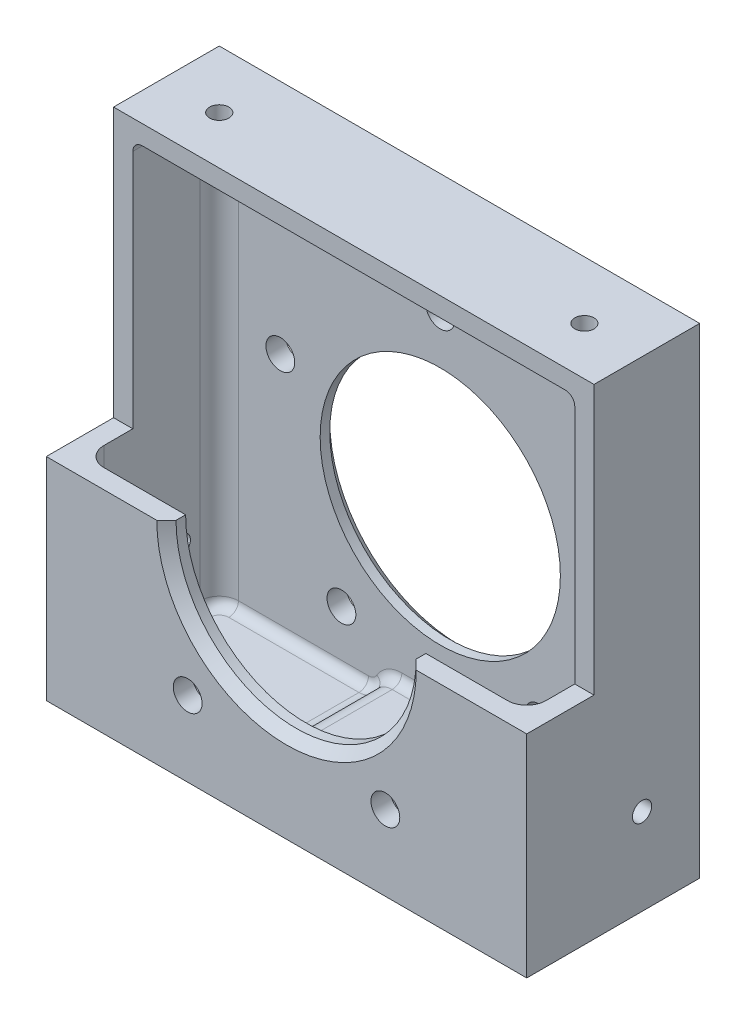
ISO-10303-21;
HEADER;
FILE_DESCRIPTION(('STEP AP214'),'2;1');
FILE_NAME('part.step','',(''),(''),'','','');
FILE_SCHEMA(('AUTOMOTIVE_DESIGN { 1 0 10303 214 1 1 1 1 }'));
ENDSEC;
DATA;
#1=APPLICATION_CONTEXT('core data for automotive mechanical design processes');
#2=APPLICATION_PROTOCOL_DEFINITION('international standard','automotive_design',2000,#1);
#3=PRODUCT_CONTEXT('',#1,'mechanical');
#4=PRODUCT('Part','Part','',(#3));
#5=PRODUCT_RELATED_PRODUCT_CATEGORY('part','',(#4));
#6=PRODUCT_DEFINITION_FORMATION('','',#4);
#7=PRODUCT_DEFINITION_CONTEXT('part definition',#1,'design');
#8=PRODUCT_DEFINITION('design','',#6,#7);
#9=PRODUCT_DEFINITION_SHAPE('','',#8);
#10=(LENGTH_UNIT() NAMED_UNIT(*) SI_UNIT(.MILLI.,.METRE.));
#11=(NAMED_UNIT(*) PLANE_ANGLE_UNIT() SI_UNIT($,.RADIAN.));
#12=(NAMED_UNIT(*) SI_UNIT($,.STERADIAN.) SOLID_ANGLE_UNIT());
#13=UNCERTAINTY_MEASURE_WITH_UNIT(LENGTH_MEASURE(1.E-05),#10,'distance_accuracy_value','');
#14=(GEOMETRIC_REPRESENTATION_CONTEXT(3) GLOBAL_UNCERTAINTY_ASSIGNED_CONTEXT((#13)) GLOBAL_UNIT_ASSIGNED_CONTEXT((#10,
#11,#12)) REPRESENTATION_CONTEXT('',''));
#15=CARTESIAN_POINT('',(0.,0.,0.));
#16=DIRECTION('',(0.,0.,1.));
#17=DIRECTION('',(1.,0.,0.));
#18=AXIS2_PLACEMENT_3D('',#15,#16,#17);
#19=CARTESIAN_POINT('',(50.,50.,18.));
#20=DIRECTION('',(0.,-1.,0.));
#21=DIRECTION('',(1.,0.,0.));
#22=AXIS2_PLACEMENT_3D('',#19,#20,#21);
#23=PLANE('',#22);
#24=DIRECTION('',(0.,0.,-1.));
#25=VECTOR('',#24,1.);
#26=CARTESIAN_POINT('',(0.,50.,18.));
#27=LINE('',#26,#25);
#28=CARTESIAN_POINT('',(0.,50.,11.));
#29=VERTEX_POINT('',#28);
#30=CARTESIAN_POINT('',(0.,50.,0.));
#31=VERTEX_POINT('',#30);
#32=EDGE_CURVE('E357',#29,#31,#27,.T.);
#33=ORIENTED_EDGE('',*,*,#32,.F.);
#34=DIRECTION('',(1.,0.,0.));
#35=VECTOR('',#34,1.);
#36=CARTESIAN_POINT('',(0.,50.,11.));
#37=LINE('',#36,#35);
#38=CARTESIAN_POINT('',(50.,50.,11.));
#39=VERTEX_POINT('',#38);
#40=EDGE_CURVE('E338',#29,#39,#37,.T.);
#41=ORIENTED_EDGE('',*,*,#40,.T.);
#42=DIRECTION('',(0.,0.,-1.));
#43=VECTOR('',#42,1.);
#44=CARTESIAN_POINT('',(50.,50.,18.));
#45=LINE('',#44,#43);
#46=CARTESIAN_POINT('',(50.,50.,0.));
#47=VERTEX_POINT('',#46);
#48=EDGE_CURVE('E373',#39,#47,#45,.T.);
#49=ORIENTED_EDGE('',*,*,#48,.T.);
#50=DIRECTION('',(-1.,0.,0.));
#51=VECTOR('',#50,1.);
#52=CARTESIAN_POINT('',(50.,50.,0.));
#53=LINE('',#52,#51);
#54=EDGE_CURVE('E360',#47,#31,#53,.T.);
#55=ORIENTED_EDGE('',*,*,#54,.T.);
#56=EDGE_LOOP('',(#33,#41,#49,#55));
#57=FACE_BOUND('',#56,.T.);
#58=CARTESIAN_POINT('',(44.,50.,5.99999999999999));
#59=DIRECTION('',(0.,1.,0.));
#60=DIRECTION('',(-1.,0.,0.));
#61=AXIS2_PLACEMENT_3D('',#58,#59,#60);
#62=CIRCLE('',#61,0.999999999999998);
#63=CARTESIAN_POINT('',(43.,50.,5.99999999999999));
#64=VERTEX_POINT('',#63);
#65=EDGE_CURVE('E1438',#64,#64,#62,.T.);
#66=ORIENTED_EDGE('',*,*,#65,.F.);
#67=EDGE_LOOP('',(#66));
#68=FACE_BOUND('',#67,.T.);
#69=CARTESIAN_POINT('',(6.,50.,6.));
#70=DIRECTION('',(0.,-1.,0.));
#71=DIRECTION('',(1.,0.,0.));
#72=AXIS2_PLACEMENT_3D('',#69,#70,#71);
#73=CIRCLE('',#72,1.);
#74=CARTESIAN_POINT('',(7.,50.,6.));
#75=VERTEX_POINT('',#74);
#76=EDGE_CURVE('E1435',#75,#75,#73,.T.);
#77=ORIENTED_EDGE('',*,*,#76,.T.);
#78=EDGE_LOOP('',(#77));
#79=FACE_BOUND('',#78,.T.);
#80=ADVANCED_FACE('F34',(#57,#68,#79),#23,.F.);
#81=CARTESIAN_POINT('',(50.,48.,18.));
#82=DIRECTION('',(0.,-1.,0.));
#83=DIRECTION('',(1.,0.,0.));
#84=AXIS2_PLACEMENT_3D('',#81,#82,#83);
#85=PLANE('',#84);
#86=CARTESIAN_POINT('',(46.,48.,4.));
#87=DIRECTION('',(0.,-1.,0.));
#88=DIRECTION('',(1.,0.,0.));
#89=AXIS2_PLACEMENT_3D('',#86,#87,#88);
#90=CIRCLE('',#89,1.);
#91=CARTESIAN_POINT('',(46.,48.,3.));
#92=VERTEX_POINT('',#91);
#93=CARTESIAN_POINT('',(47.,48.,4.));
#94=VERTEX_POINT('',#93);
#95=EDGE_CURVE('E527',#92,#94,#90,.T.);
#96=ORIENTED_EDGE('',*,*,#95,.T.);
#97=DIRECTION('',(0.,0.,-1.));
#98=VECTOR('',#97,1.);
#99=CARTESIAN_POINT('',(47.,48.,18.));
#100=LINE('',#99,#98);
#101=CARTESIAN_POINT('',(47.,48.,11.));
#102=VERTEX_POINT('',#101);
#103=EDGE_CURVE('E531',#94,#102,#100,.F.);
#104=ORIENTED_EDGE('',*,*,#103,.T.);
#105=DIRECTION('',(1.,0.,0.));
#106=VECTOR('',#105,1.);
#107=CARTESIAN_POINT('',(50.,48.,11.));
#108=LINE('',#107,#106);
#109=CARTESIAN_POINT('',(3.,48.,11.));
#110=VERTEX_POINT('',#109);
#111=EDGE_CURVE('E294',#110,#102,#108,.T.);
#112=ORIENTED_EDGE('',*,*,#111,.F.);
#113=DIRECTION('',(0.,0.,-1.));
#114=VECTOR('',#113,1.);
#115=CARTESIAN_POINT('',(3.,48.,18.));
#116=LINE('',#115,#114);
#117=CARTESIAN_POINT('',(2.99999999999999,48.,4.));
#118=VERTEX_POINT('',#117);
#119=EDGE_CURVE('E529',#110,#118,#116,.T.);
#120=ORIENTED_EDGE('',*,*,#119,.T.);
#121=CARTESIAN_POINT('',(3.99999999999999,48.,4.));
#122=DIRECTION('',(0.,-1.,0.));
#123=DIRECTION('',(1.,0.,0.));
#124=AXIS2_PLACEMENT_3D('',#121,#122,#123);
#125=CIRCLE('',#124,1.);
#126=CARTESIAN_POINT('',(3.99999999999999,48.,3.));
#127=VERTEX_POINT('',#126);
#128=EDGE_CURVE('E525',#118,#127,#125,.T.);
#129=ORIENTED_EDGE('',*,*,#128,.T.);
#130=DIRECTION('',(-1.,0.,0.));
#131=VECTOR('',#130,1.);
#132=CARTESIAN_POINT('',(50.,48.,3.));
#133=LINE('',#132,#131);
#134=EDGE_CURVE('E523',#127,#92,#133,.F.);
#135=ORIENTED_EDGE('',*,*,#134,.T.);
#136=EDGE_LOOP('',(#96,#104,#112,#120,#129,#135));
#137=FACE_BOUND('',#136,.T.);
#138=CARTESIAN_POINT('',(44.,48.,5.99999999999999));
#139=DIRECTION('',(0.,-1.,0.));
#140=DIRECTION('',(1.,0.,0.));
#141=AXIS2_PLACEMENT_3D('',#138,#139,#140);
#142=CIRCLE('',#141,0.999999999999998);
#143=CARTESIAN_POINT('',(45.,48.,5.99999999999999));
#144=VERTEX_POINT('',#143);
#145=EDGE_CURVE('E378',#144,#144,#142,.F.);
#146=ORIENTED_EDGE('',*,*,#145,.T.);
#147=EDGE_LOOP('',(#146));
#148=FACE_BOUND('',#147,.T.);
#149=CARTESIAN_POINT('',(6.,48.,6.));
#150=DIRECTION('',(0.,-1.,0.));
#151=DIRECTION('',(1.,0.,0.));
#152=AXIS2_PLACEMENT_3D('',#149,#150,#151);
#153=CIRCLE('',#152,1.);
#154=CARTESIAN_POINT('',(7.,48.,6.));
#155=VERTEX_POINT('',#154);
#156=EDGE_CURVE('E1432',#155,#155,#153,.T.);
#157=ORIENTED_EDGE('',*,*,#156,.F.);
#158=EDGE_LOOP('',(#157));
#159=FACE_BOUND('',#158,.T.);
#160=ADVANCED_FACE('F622',(#137,#148,#159),#85,.T.);
#161=CARTESIAN_POINT('',(0.,22.,11.));
#162=DIRECTION('',(0.,1.,0.));
#163=DIRECTION('',(-1.,0.,0.));
#164=AXIS2_PLACEMENT_3D('',#161,#162,#163);
#165=PLANE('',#164);
#166=DIRECTION('',(1.,0.,0.));
#167=VECTOR('',#166,1.);
#168=CARTESIAN_POINT('',(0.,22.,18.));
#169=LINE('',#168,#167);
#170=CARTESIAN_POINT('',(0.,22.,18.));
#171=VERTEX_POINT('',#170);
#172=CARTESIAN_POINT('',(11.5,22.,18.));
#173=VERTEX_POINT('',#172);
#174=EDGE_CURVE('E346',#171,#173,#169,.T.);
#175=ORIENTED_EDGE('',*,*,#174,.T.);
#176=DIRECTION('',(-0.707106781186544,0.,0.707106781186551));
#177=VECTOR('',#176,1.);
#178=CARTESIAN_POINT('',(25.,22.,4.49999999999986));
#179=LINE('',#178,#177);
#180=CARTESIAN_POINT('',(12.5,22.,17.));
#181=VERTEX_POINT('',#180);
#182=EDGE_CURVE('E310',#173,#181,#179,.F.);
#183=ORIENTED_EDGE('',*,*,#182,.T.);
#184=DIRECTION('',(0.,0.,1.));
#185=VECTOR('',#184,1.);
#186=CARTESIAN_POINT('',(12.5,22.,0.));
#187=LINE('',#186,#185);
#188=CARTESIAN_POINT('',(12.5,22.,16.));
#189=VERTEX_POINT('',#188);
#190=EDGE_CURVE('E301',#189,#181,#187,.T.);
#191=ORIENTED_EDGE('',*,*,#190,.F.);
#192=DIRECTION('',(1.,0.,0.));
#193=VECTOR('',#192,1.);
#194=CARTESIAN_POINT('',(0.,22.,16.));
#195=LINE('',#194,#193);
#196=CARTESIAN_POINT('',(4.,22.,16.));
#197=VERTEX_POINT('',#196);
#198=EDGE_CURVE('E283',#197,#189,#195,.T.);
#199=ORIENTED_EDGE('',*,*,#198,.F.);
#200=CARTESIAN_POINT('',(4.,22.,14.));
#201=DIRECTION('',(0.,1.,0.));
#202=DIRECTION('',(-1.,0.,0.));
#203=AXIS2_PLACEMENT_3D('',#200,#201,#202);
#204=CIRCLE('',#203,2.);
#205=CARTESIAN_POINT('',(2.,22.,14.));
#206=VERTEX_POINT('',#205);
#207=EDGE_CURVE('E416',#197,#206,#204,.F.);
#208=ORIENTED_EDGE('',*,*,#207,.T.);
#209=DIRECTION('',(0.,0.,1.));
#210=VECTOR('',#209,1.);
#211=CARTESIAN_POINT('',(2.,22.,11.));
#212=LINE('',#211,#210);
#213=CARTESIAN_POINT('',(2.,22.,11.));
#214=VERTEX_POINT('',#213);
#215=EDGE_CURVE('E320',#214,#206,#212,.T.);
#216=ORIENTED_EDGE('',*,*,#215,.F.);
#217=DIRECTION('',(1.,0.,0.));
#218=VECTOR('',#217,1.);
#219=CARTESIAN_POINT('',(0.,22.,11.));
#220=LINE('',#219,#218);
#221=CARTESIAN_POINT('',(0.,22.,11.));
#222=VERTEX_POINT('',#221);
#223=EDGE_CURVE('E342',#222,#214,#220,.T.);
#224=ORIENTED_EDGE('',*,*,#223,.F.);
#225=DIRECTION('',(0.,0.,1.));
#226=VECTOR('',#225,1.);
#227=CARTESIAN_POINT('',(0.,22.,11.));
#228=LINE('',#227,#226);
#229=EDGE_CURVE('E328',#222,#171,#228,.T.);
#230=ORIENTED_EDGE('',*,*,#229,.T.);
#231=EDGE_LOOP('',(#175,#183,#191,#199,#208,#216,#224,#230));
#232=FACE_BOUND('',#231,.T.);
#233=ADVANCED_FACE('F308',(#232),#165,.T.);
#234=CARTESIAN_POINT('',(0.,2.,18.));
#235=DIRECTION('',(0.,1.,0.));
#236=DIRECTION('',(0.,0.,1.));
#237=AXIS2_PLACEMENT_3D('',#234,#235,#236);
#238=PLANE('',#237);
#239=CARTESIAN_POINT('',(46.,2.,4.));
#240=DIRECTION('',(0.,1.,0.));
#241=DIRECTION('',(0.,0.,1.));
#242=AXIS2_PLACEMENT_3D('',#239,#240,#241);
#243=CIRCLE('',#242,1.);
#244=CARTESIAN_POINT('',(47.,2.,4.));
#245=VERTEX_POINT('',#244);
#246=CARTESIAN_POINT('',(46.,2.,3.));
#247=VERTEX_POINT('',#246);
#248=EDGE_CURVE('E459',#245,#247,#243,.T.);
#249=ORIENTED_EDGE('',*,*,#248,.T.);
#250=DIRECTION('',(1.,0.,0.));
#251=VECTOR('',#250,1.);
#252=CARTESIAN_POINT('',(0.,2.,3.));
#253=LINE('',#252,#251);
#254=CARTESIAN_POINT('',(33.,2.,3.));
#255=VERTEX_POINT('',#254);
#256=EDGE_CURVE('E461',#247,#255,#253,.F.);
#257=ORIENTED_EDGE('',*,*,#256,.T.);
#258=DIRECTION('',(0.,0.,1.));
#259=VECTOR('',#258,1.);
#260=CARTESIAN_POINT('',(33.,2.,18.));
#261=LINE('',#260,#259);
#262=CARTESIAN_POINT('',(33.,2.,15.));
#263=VERTEX_POINT('',#262);
#264=EDGE_CURVE('E418',#255,#263,#261,.T.);
#265=ORIENTED_EDGE('',*,*,#264,.T.);
#266=DIRECTION('',(1.,0.,0.));
#267=VECTOR('',#266,1.);
#268=CARTESIAN_POINT('',(46.,2.,15.));
#269=LINE('',#268,#267);
#270=CARTESIAN_POINT('',(46.,2.,15.));
#271=VERTEX_POINT('',#270);
#272=EDGE_CURVE('E453',#263,#271,#269,.T.);
#273=ORIENTED_EDGE('',*,*,#272,.T.);
#274=CARTESIAN_POINT('',(46.,2.,14.));
#275=DIRECTION('',(0.,1.,0.));
#276=DIRECTION('',(0.,0.,1.));
#277=AXIS2_PLACEMENT_3D('',#274,#275,#276);
#278=CIRCLE('',#277,1.);
#279=CARTESIAN_POINT('',(47.,2.,14.));
#280=VERTEX_POINT('',#279);
#281=EDGE_CURVE('E455',#271,#280,#278,.T.);
#282=ORIENTED_EDGE('',*,*,#281,.T.);
#283=DIRECTION('',(0.,0.,-1.));
#284=VECTOR('',#283,1.);
#285=CARTESIAN_POINT('',(47.,2.,18.));
#286=LINE('',#285,#284);
#287=EDGE_CURVE('E457',#280,#245,#286,.T.);
#288=ORIENTED_EDGE('',*,*,#287,.T.);
#289=EDGE_LOOP('',(#249,#257,#265,#273,#282,#288));
#290=FACE_BOUND('',#289,.T.);
#291=ADVANCED_FACE('F658',(#290),#238,.T.);
#292=CARTESIAN_POINT('',(0.,22.,11.));
#293=DIRECTION('',(0.,0.,-1.));
#294=DIRECTION('',(-1.,0.,0.));
#295=AXIS2_PLACEMENT_3D('',#292,#293,#294);
#296=PLANE('',#295);
#297=DIRECTION('',(0.,1.,0.));
#298=VECTOR('',#297,1.);
#299=CARTESIAN_POINT('',(48.,50.,11.));
#300=LINE('',#299,#298);
#301=CARTESIAN_POINT('',(48.,22.,11.));
#302=VERTEX_POINT('',#301);
#303=CARTESIAN_POINT('',(48.,47.,11.));
#304=VERTEX_POINT('',#303);
#305=EDGE_CURVE('E314',#302,#304,#300,.T.);
#306=ORIENTED_EDGE('',*,*,#305,.F.);
#307=CARTESIAN_POINT('',(50.,22.,11.));
#308=VERTEX_POINT('',#307);
#309=EDGE_CURVE('E345',#302,#308,#220,.T.);
#310=ORIENTED_EDGE('',*,*,#309,.T.);
#311=DIRECTION('',(0.,1.,0.));
#312=VECTOR('',#311,1.);
#313=CARTESIAN_POINT('',(50.,22.,11.));
#314=LINE('',#313,#312);
#315=EDGE_CURVE('E331',#308,#39,#314,.T.);
#316=ORIENTED_EDGE('',*,*,#315,.T.);
#317=ORIENTED_EDGE('',*,*,#40,.F.);
#318=DIRECTION('',(0.,1.,0.));
#319=VECTOR('',#318,1.);
#320=CARTESIAN_POINT('',(0.,22.,11.));
#321=LINE('',#320,#319);
#322=EDGE_CURVE('E330',#222,#29,#321,.T.);
#323=ORIENTED_EDGE('',*,*,#322,.F.);
#324=ORIENTED_EDGE('',*,*,#223,.T.);
#325=DIRECTION('',(0.,1.,0.));
#326=VECTOR('',#325,1.);
#327=CARTESIAN_POINT('',(2.,22.,11.));
#328=LINE('',#327,#326);
#329=CARTESIAN_POINT('',(1.99999999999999,47.,11.));
#330=VERTEX_POINT('',#329);
#331=EDGE_CURVE('E324',#214,#330,#328,.T.);
#332=ORIENTED_EDGE('',*,*,#331,.T.);
#333=CARTESIAN_POINT('',(3.,47.,11.));
#334=DIRECTION('',(0.,0.,-1.));
#335=DIRECTION('',(-1.,0.,0.));
#336=AXIS2_PLACEMENT_3D('',#333,#334,#335);
#337=CIRCLE('',#336,1.);
#338=EDGE_CURVE('E11',#330,#110,#337,.T.);
#339=ORIENTED_EDGE('',*,*,#338,.T.);
#340=ORIENTED_EDGE('',*,*,#111,.T.);
#341=CARTESIAN_POINT('',(47.,47.,11.));
#342=DIRECTION('',(0.,0.,-1.));
#343=DIRECTION('',(-1.,0.,0.));
#344=AXIS2_PLACEMENT_3D('',#341,#342,#343);
#345=CIRCLE('',#344,1.);
#346=EDGE_CURVE('E43',#102,#304,#345,.T.);
#347=ORIENTED_EDGE('',*,*,#346,.T.);
#348=EDGE_LOOP('',(#306,#310,#316,#317,#323,#324,#332,#339,#340,#347));
#349=FACE_BOUND('',#348,.T.);
#350=ADVANCED_FACE('F619',(#349),#296,.F.);
#351=DIRECTION('',(0.,0.,1.));
#352=VECTOR('',#351,1.);
#353=CARTESIAN_POINT('',(37.5,22.,0.));
#354=LINE('',#353,#352);
#355=CARTESIAN_POINT('',(37.5,22.,17.));
#356=VERTEX_POINT('',#355);
#357=CARTESIAN_POINT('',(37.5,22.,16.));
#358=VERTEX_POINT('',#357);
#359=EDGE_CURVE('E304',#356,#358,#354,.F.);
#360=ORIENTED_EDGE('',*,*,#359,.F.);
#361=DIRECTION('',(-0.707106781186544,0.,-0.707106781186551));
#362=VECTOR('',#361,1.);
#363=CARTESIAN_POINT('',(25.,22.,4.49999999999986));
#364=LINE('',#363,#362);
#365=CARTESIAN_POINT('',(38.5,22.,18.));
#366=VERTEX_POINT('',#365);
#367=EDGE_CURVE('E380',#356,#366,#364,.F.);
#368=ORIENTED_EDGE('',*,*,#367,.T.);
#369=CARTESIAN_POINT('',(50.,22.,18.));
#370=VERTEX_POINT('',#369);
#371=EDGE_CURVE('E334',#366,#370,#169,.T.);
#372=ORIENTED_EDGE('',*,*,#371,.T.);
#373=DIRECTION('',(0.,0.,1.));
#374=VECTOR('',#373,1.);
#375=CARTESIAN_POINT('',(50.,22.,11.));
#376=LINE('',#375,#374);
#377=EDGE_CURVE('E323',#308,#370,#376,.T.);
#378=ORIENTED_EDGE('',*,*,#377,.F.);
#379=ORIENTED_EDGE('',*,*,#309,.F.);
#380=DIRECTION('',(0.,0.,1.));
#381=VECTOR('',#380,1.);
#382=CARTESIAN_POINT('',(48.,22.,18.));
#383=LINE('',#382,#381);
#384=CARTESIAN_POINT('',(48.,22.,14.));
#385=VERTEX_POINT('',#384);
#386=EDGE_CURVE('E311',#302,#385,#383,.T.);
#387=ORIENTED_EDGE('',*,*,#386,.T.);
#388=CARTESIAN_POINT('',(46.,22.,14.));
#389=DIRECTION('',(0.,1.,0.));
#390=DIRECTION('',(-1.,0.,0.));
#391=AXIS2_PLACEMENT_3D('',#388,#389,#390);
#392=CIRCLE('',#391,2.);
#393=CARTESIAN_POINT('',(46.,22.,16.));
#394=VERTEX_POINT('',#393);
#395=EDGE_CURVE('E414',#385,#394,#392,.F.);
#396=ORIENTED_EDGE('',*,*,#395,.T.);
#397=EDGE_CURVE('E295',#358,#394,#195,.T.);
#398=ORIENTED_EDGE('',*,*,#397,.F.);
#399=EDGE_LOOP('',(#360,#368,#372,#378,#379,#387,#396,#398));
#400=FACE_BOUND('',#399,.T.);
#401=ADVANCED_FACE('F687',(#400),#165,.T.);
#402=CARTESIAN_POINT('',(0.,0.,18.));
#403=DIRECTION('',(0.,0.,-1.));
#404=DIRECTION('',(-1.,0.,0.));
#405=AXIS2_PLACEMENT_3D('',#402,#403,#404);
#406=PLANE('',#405);
#407=CARTESIAN_POINT('',(14.7137580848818,7.84220259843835,18.));
#408=DIRECTION('',(0.,0.,1.));
#409=DIRECTION('',(1.,0.,0.));
#410=AXIS2_PLACEMENT_3D('',#407,#408,#409);
#411=CIRCLE('',#410,1.5);
#412=CARTESIAN_POINT('',(16.2137580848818,7.84220259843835,18.));
#413=VERTEX_POINT('',#412);
#414=EDGE_CURVE('E1362',#413,#413,#411,.T.);
#415=ORIENTED_EDGE('',*,*,#414,.F.);
#416=EDGE_LOOP('',(#415));
#417=FACE_BOUND('',#416,.T.);
#418=CARTESIAN_POINT('',(35.2862419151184,7.8422025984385,18.));
#419=DIRECTION('',(0.,0.,1.));
#420=DIRECTION('',(1.,0.,0.));
#421=AXIS2_PLACEMENT_3D('',#418,#419,#420);
#422=CIRCLE('',#421,1.5);
#423=CARTESIAN_POINT('',(36.7862419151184,7.8422025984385,18.));
#424=VERTEX_POINT('',#423);
#425=EDGE_CURVE('E1366',#424,#424,#422,.T.);
#426=ORIENTED_EDGE('',*,*,#425,.F.);
#427=EDGE_LOOP('',(#426));
#428=FACE_BOUND('',#427,.T.);
#429=ORIENTED_EDGE('',*,*,#371,.F.);
#430=CARTESIAN_POINT('',(25.,22.,18.));
#431=DIRECTION('',(0.,0.,-1.));
#432=DIRECTION('',(-1.,0.,0.));
#433=AXIS2_PLACEMENT_3D('',#430,#431,#432);
#434=CIRCLE('',#433,13.5);
#435=EDGE_CURVE('E382',#366,#173,#434,.T.);
#436=ORIENTED_EDGE('',*,*,#435,.T.);
#437=ORIENTED_EDGE('',*,*,#174,.F.);
#438=DIRECTION('',(0.,1.,0.));
#439=VECTOR('',#438,1.);
#440=CARTESIAN_POINT('',(0.,0.,18.));
#441=LINE('',#440,#439);
#442=CARTESIAN_POINT('',(0.,0.,18.));
#443=VERTEX_POINT('',#442);
#444=EDGE_CURVE('E348',#443,#171,#441,.T.);
#445=ORIENTED_EDGE('',*,*,#444,.F.);
#446=DIRECTION('',(1.,0.,0.));
#447=VECTOR('',#446,1.);
#448=CARTESIAN_POINT('',(0.,0.,18.));
#449=LINE('',#448,#447);
#450=CARTESIAN_POINT('',(50.,0.,18.));
#451=VERTEX_POINT('',#450);
#452=EDGE_CURVE('E355',#443,#451,#449,.T.);
#453=ORIENTED_EDGE('',*,*,#452,.T.);
#454=DIRECTION('',(0.,-1.,0.));
#455=VECTOR('',#454,1.);
#456=CARTESIAN_POINT('',(50.,50.,18.));
#457=LINE('',#456,#455);
#458=EDGE_CURVE('E351',#370,#451,#457,.T.);
#459=ORIENTED_EDGE('',*,*,#458,.F.);
#460=EDGE_LOOP('',(#429,#436,#437,#445,#453,#459));
#461=FACE_BOUND('',#460,.T.);
#462=ADVANCED_FACE('F785',(#417,#428,#461),#406,.F.);
#463=CARTESIAN_POINT('',(0.,0.,18.));
#464=DIRECTION('',(-1.,0.,0.));
#465=DIRECTION('',(0.,-1.,0.));
#466=AXIS2_PLACEMENT_3D('',#463,#464,#465);
#467=PLANE('',#466);
#468=CARTESIAN_POINT('',(0.,8.99999999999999,5.99999999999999));
#469=DIRECTION('',(1.,0.,0.));
#470=DIRECTION('',(0.,1.,0.));
#471=AXIS2_PLACEMENT_3D('',#468,#469,#470);
#472=CIRCLE('',#471,1.);
#473=CARTESIAN_POINT('',(0.,9.99999999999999,5.99999999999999));
#474=VERTEX_POINT('',#473);
#475=EDGE_CURVE('E396',#474,#474,#472,.T.);
#476=ORIENTED_EDGE('',*,*,#475,.T.);
#477=EDGE_LOOP('',(#476));
#478=FACE_BOUND('',#477,.T.);
#479=ORIENTED_EDGE('',*,*,#322,.T.);
#480=ORIENTED_EDGE('',*,*,#32,.T.);
#481=DIRECTION('',(0.,1.,0.));
#482=VECTOR('',#481,1.);
#483=CARTESIAN_POINT('',(0.,0.,0.));
#484=LINE('',#483,#482);
#485=CARTESIAN_POINT('',(0.,0.,0.));
#486=VERTEX_POINT('',#485);
#487=EDGE_CURVE('E341',#486,#31,#484,.T.);
#488=ORIENTED_EDGE('',*,*,#487,.F.);
#489=DIRECTION('',(0.,0.,-1.));
#490=VECTOR('',#489,1.);
#491=CARTESIAN_POINT('',(0.,0.,18.));
#492=LINE('',#491,#490);
#493=EDGE_CURVE('E367',#443,#486,#492,.T.);
#494=ORIENTED_EDGE('',*,*,#493,.F.);
#495=ORIENTED_EDGE('',*,*,#444,.T.);
#496=ORIENTED_EDGE('',*,*,#229,.F.);
#497=EDGE_LOOP('',(#479,#480,#488,#494,#495,#496));
#498=FACE_BOUND('',#497,.T.);
#499=ADVANCED_FACE('F781',(#478,#498),#467,.T.);
#500=CARTESIAN_POINT('',(0.,0.,18.));
#501=DIRECTION('',(0.,1.,0.));
#502=DIRECTION('',(0.,0.,1.));
#503=AXIS2_PLACEMENT_3D('',#500,#501,#502);
#504=PLANE('',#503);
#505=DIRECTION('',(0.,0.,-1.));
#506=VECTOR('',#505,1.);
#507=CARTESIAN_POINT('',(50.,0.,18.));
#508=LINE('',#507,#506);
#509=CARTESIAN_POINT('',(50.,0.,0.));
#510=VERTEX_POINT('',#509);
#511=EDGE_CURVE('E370',#451,#510,#508,.T.);
#512=ORIENTED_EDGE('',*,*,#511,.F.);
#513=ORIENTED_EDGE('',*,*,#452,.F.);
#514=ORIENTED_EDGE('',*,*,#493,.T.);
#515=DIRECTION('',(1.,0.,0.));
#516=VECTOR('',#515,1.);
#517=CARTESIAN_POINT('',(0.,0.,0.));
#518=LINE('',#517,#516);
#519=EDGE_CURVE('E352',#486,#510,#518,.T.);
#520=ORIENTED_EDGE('',*,*,#519,.T.);
#521=EDGE_LOOP('',(#512,#513,#514,#520));
#522=FACE_BOUND('',#521,.T.);
#523=ADVANCED_FACE('F784',(#522),#504,.F.);
#524=CARTESIAN_POINT('',(50.,50.,18.));
#525=DIRECTION('',(1.,0.,0.));
#526=DIRECTION('',(0.,0.,-1.));
#527=AXIS2_PLACEMENT_3D('',#524,#525,#526);
#528=PLANE('',#527);
#529=CARTESIAN_POINT('',(50.,9.,5.99999999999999));
#530=DIRECTION('',(1.,0.,0.));
#531=DIRECTION('',(0.,1.,0.));
#532=AXIS2_PLACEMENT_3D('',#529,#530,#531);
#533=CIRCLE('',#532,1.);
#534=CARTESIAN_POINT('',(50.,10.,5.99999999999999));
#535=VERTEX_POINT('',#534);
#536=EDGE_CURVE('E1425',#535,#535,#533,.T.);
#537=ORIENTED_EDGE('',*,*,#536,.F.);
#538=EDGE_LOOP('',(#537));
#539=FACE_BOUND('',#538,.T.);
#540=ORIENTED_EDGE('',*,*,#315,.F.);
#541=ORIENTED_EDGE('',*,*,#377,.T.);
#542=ORIENTED_EDGE('',*,*,#458,.T.);
#543=ORIENTED_EDGE('',*,*,#511,.T.);
#544=DIRECTION('',(0.,-1.,0.));
#545=VECTOR('',#544,1.);
#546=CARTESIAN_POINT('',(50.,50.,0.));
#547=LINE('',#546,#545);
#548=EDGE_CURVE('E363',#47,#510,#547,.T.);
#549=ORIENTED_EDGE('',*,*,#548,.F.);
#550=ORIENTED_EDGE('',*,*,#48,.F.);
#551=EDGE_LOOP('',(#540,#541,#542,#543,#549,#550));
#552=FACE_BOUND('',#551,.T.);
#553=ADVANCED_FACE('F779',(#539,#552),#528,.T.);
#554=CARTESIAN_POINT('',(0.,0.,0.));
#555=DIRECTION('',(0.,0.,-1.));
#556=DIRECTION('',(-1.,0.,0.));
#557=AXIS2_PLACEMENT_3D('',#554,#555,#556);
#558=PLANE('',#557);
#559=CARTESIAN_POINT('',(41.6434890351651,27.4077974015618,0.));
#560=DIRECTION('',(0.,0.,-1.));
#561=DIRECTION('',(-0.309016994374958,0.95105651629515,0.));
#562=AXIS2_PLACEMENT_3D('',#559,#560,#561);
#563=CIRCLE('',#562,1.5);
#564=CARTESIAN_POINT('',(41.1799635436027,28.8343821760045,0.));
#565=VERTEX_POINT('',#564);
#566=EDGE_CURVE('E1388',#565,#565,#563,.T.);
#567=ORIENTED_EDGE('',*,*,#566,.F.);
#568=EDGE_LOOP('',(#567));
#569=FACE_BOUND('',#568,.T.);
#570=CARTESIAN_POINT('',(35.2862419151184,7.84220259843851,0.));
#571=DIRECTION('',(0.,0.,-1.));
#572=DIRECTION('',(0.809016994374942,0.58778525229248,0.));
#573=AXIS2_PLACEMENT_3D('',#570,#571,#572);
#574=CIRCLE('',#573,1.5);
#575=CARTESIAN_POINT('',(36.4997674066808,8.72388047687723,0.));
#576=VERTEX_POINT('',#575);
#577=EDGE_CURVE('E1401',#576,#576,#574,.T.);
#578=ORIENTED_EDGE('',*,*,#577,.F.);
#579=EDGE_LOOP('',(#578));
#580=FACE_BOUND('',#579,.T.);
#581=CARTESIAN_POINT('',(14.7137580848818,7.84220259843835,0.));
#582=DIRECTION('',(0.,0.,-1.));
#583=DIRECTION('',(0.809016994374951,-0.587785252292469,0.));
#584=AXIS2_PLACEMENT_3D('',#581,#582,#583);
#585=CIRCLE('',#584,1.5);
#586=CARTESIAN_POINT('',(15.9272835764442,6.96052471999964,0.));
#587=VERTEX_POINT('',#586);
#588=EDGE_CURVE('E1407',#587,#587,#585,.T.);
#589=ORIENTED_EDGE('',*,*,#588,.F.);
#590=EDGE_LOOP('',(#589));
#591=FACE_BOUND('',#590,.T.);
#592=CARTESIAN_POINT('',(8.35651096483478,27.4077974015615,0.));
#593=DIRECTION('',(0.,0.,-1.));
#594=DIRECTION('',(-0.309016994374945,-0.951056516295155,0.));
#595=AXIS2_PLACEMENT_3D('',#592,#593,#594);
#596=CIRCLE('',#595,1.5);
#597=CARTESIAN_POINT('',(7.89298547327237,25.9812126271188,0.));
#598=VERTEX_POINT('',#597);
#599=EDGE_CURVE('E1413',#598,#598,#596,.T.);
#600=ORIENTED_EDGE('',*,*,#599,.F.);
#601=EDGE_LOOP('',(#600));
#602=FACE_BOUND('',#601,.T.);
#603=CARTESIAN_POINT('',(25.,39.5,0.));
#604=DIRECTION('',(0.,0.,-1.));
#605=DIRECTION('',(-1.,0.,0.));
#606=AXIS2_PLACEMENT_3D('',#603,#604,#605);
#607=CIRCLE('',#606,1.5);
#608=CARTESIAN_POINT('',(23.5,39.5,0.));
#609=VERTEX_POINT('',#608);
#610=EDGE_CURVE('E1419',#609,#609,#607,.T.);
#611=ORIENTED_EDGE('',*,*,#610,.F.);
#612=EDGE_LOOP('',(#611));
#613=FACE_BOUND('',#612,.T.);
#614=CARTESIAN_POINT('',(25.,22.,0.));
#615=DIRECTION('',(0.,0.,-1.));
#616=DIRECTION('',(-1.,0.,0.));
#617=AXIS2_PLACEMENT_3D('',#614,#615,#616);
#618=CIRCLE('',#617,13.5);
#619=CARTESIAN_POINT('',(11.5,22.,0.));
#620=VERTEX_POINT('',#619);
#621=EDGE_CURVE('E385',#620,#620,#618,.F.);
#622=ORIENTED_EDGE('',*,*,#621,.T.);
#623=EDGE_LOOP('',(#622));
#624=FACE_BOUND('',#623,.T.);
#625=ORIENTED_EDGE('',*,*,#548,.T.);
#626=ORIENTED_EDGE('',*,*,#519,.F.);
#627=ORIENTED_EDGE('',*,*,#487,.T.);
#628=ORIENTED_EDGE('',*,*,#54,.F.);
#629=EDGE_LOOP('',(#625,#626,#627,#628));
#630=FACE_BOUND('',#629,.T.);
#631=ADVANCED_FACE('F1221',(#569,#580,#591,#602,#613,#624,#630),#558,.T.);
#632=CARTESIAN_POINT('',(0.,0.,16.));
#633=DIRECTION('',(0.,0.,-1.));
#634=DIRECTION('',(-1.,0.,0.));
#635=AXIS2_PLACEMENT_3D('',#632,#633,#634);
#636=PLANE('',#635);
#637=CARTESIAN_POINT('',(14.7137580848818,7.84220259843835,16.));
#638=DIRECTION('',(0.,0.,-1.));
#639=DIRECTION('',(-1.,0.,0.));
#640=AXIS2_PLACEMENT_3D('',#637,#638,#639);
#641=CIRCLE('',#640,1.5);
#642=CARTESIAN_POINT('',(13.2137580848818,7.84220259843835,16.));
#643=VERTEX_POINT('',#642);
#644=EDGE_CURVE('E596',#643,#643,#641,.F.);
#645=ORIENTED_EDGE('',*,*,#644,.T.);
#646=EDGE_LOOP('',(#645));
#647=FACE_BOUND('',#646,.T.);
#648=CARTESIAN_POINT('',(35.2862419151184,7.8422025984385,16.));
#649=DIRECTION('',(0.,0.,-1.));
#650=DIRECTION('',(-1.,0.,0.));
#651=AXIS2_PLACEMENT_3D('',#648,#649,#650);
#652=CIRCLE('',#651,1.5);
#653=CARTESIAN_POINT('',(33.7862419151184,7.8422025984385,16.));
#654=VERTEX_POINT('',#653);
#655=EDGE_CURVE('E1389',#654,#654,#652,.F.);
#656=ORIENTED_EDGE('',*,*,#655,.T.);
#657=EDGE_LOOP('',(#656));
#658=FACE_BOUND('',#657,.T.);
#659=DIRECTION('',(0.,-1.,0.));
#660=VECTOR('',#659,1.);
#661=CARTESIAN_POINT('',(46.,0.,16.));
#662=LINE('',#661,#660);
#663=CARTESIAN_POINT('',(46.,3.,16.));
#664=VERTEX_POINT('',#663);
#665=EDGE_CURVE('E408',#394,#664,#662,.T.);
#666=ORIENTED_EDGE('',*,*,#665,.T.);
#667=DIRECTION('',(1.,0.,0.));
#668=VECTOR('',#667,1.);
#669=CARTESIAN_POINT('',(33.,3.,16.));
#670=LINE('',#669,#668);
#671=CARTESIAN_POINT('',(33.,3.,16.));
#672=VERTEX_POINT('',#671);
#673=EDGE_CURVE('E503',#664,#672,#670,.F.);
#674=ORIENTED_EDGE('',*,*,#673,.T.);
#675=CARTESIAN_POINT('',(33.,4.,16.));
#676=DIRECTION('',(0.,0.,-1.));
#677=DIRECTION('',(-1.,0.,0.));
#678=AXIS2_PLACEMENT_3D('',#675,#676,#677);
#679=CIRCLE('',#678,1.);
#680=CARTESIAN_POINT('',(32.1339745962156,3.5,16.));
#681=VERTEX_POINT('',#680);
#682=EDGE_CURVE('E501',#672,#681,#679,.T.);
#683=ORIENTED_EDGE('',*,*,#682,.T.);
#684=CARTESIAN_POINT('',(29.5358983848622,2.,16.));
#685=DIRECTION('',(0.,0.,-1.));
#686=DIRECTION('',(-1.,0.,0.));
#687=AXIS2_PLACEMENT_3D('',#684,#685,#686);
#688=CIRCLE('',#687,3.);
#689=CARTESIAN_POINT('',(29.5358983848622,5.,16.));
#690=VERTEX_POINT('',#689);
#691=EDGE_CURVE('E499',#681,#690,#688,.F.);
#692=ORIENTED_EDGE('',*,*,#691,.T.);
#693=DIRECTION('',(1.,0.,0.));
#694=VECTOR('',#693,1.);
#695=CARTESIAN_POINT('',(21.,5.,16.));
#696=LINE('',#695,#694);
#697=CARTESIAN_POINT('',(21.,5.,16.));
#698=VERTEX_POINT('',#697);
#699=EDGE_CURVE('E497',#690,#698,#696,.F.);
#700=ORIENTED_EDGE('',*,*,#699,.T.);
#701=CARTESIAN_POINT('',(21.,2.,16.));
#702=DIRECTION('',(0.,0.,-1.));
#703=DIRECTION('',(-1.,0.,0.));
#704=AXIS2_PLACEMENT_3D('',#701,#702,#703);
#705=CIRCLE('',#704,3.);
#706=CARTESIAN_POINT('',(18.4019237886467,3.5,16.));
#707=VERTEX_POINT('',#706);
#708=EDGE_CURVE('E495',#698,#707,#705,.F.);
#709=ORIENTED_EDGE('',*,*,#708,.T.);
#710=CARTESIAN_POINT('',(17.5358983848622,4.,16.));
#711=DIRECTION('',(0.,0.,-1.));
#712=DIRECTION('',(-1.,0.,0.));
#713=AXIS2_PLACEMENT_3D('',#710,#711,#712);
#714=CIRCLE('',#713,1.);
#715=CARTESIAN_POINT('',(17.5358983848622,3.,16.));
#716=VERTEX_POINT('',#715);
#717=EDGE_CURVE('E493',#707,#716,#714,.T.);
#718=ORIENTED_EDGE('',*,*,#717,.T.);
#719=DIRECTION('',(1.,0.,0.));
#720=VECTOR('',#719,1.);
#721=CARTESIAN_POINT('',(4.,3.,16.));
#722=LINE('',#721,#720);
#723=CARTESIAN_POINT('',(4.,3.,16.));
#724=VERTEX_POINT('',#723);
#725=EDGE_CURVE('E491',#716,#724,#722,.F.);
#726=ORIENTED_EDGE('',*,*,#725,.T.);
#727=DIRECTION('',(0.,1.,0.));
#728=VECTOR('',#727,1.);
#729=CARTESIAN_POINT('',(4.,0.,16.));
#730=LINE('',#729,#728);
#731=EDGE_CURVE('E290',#724,#197,#730,.T.);
#732=ORIENTED_EDGE('',*,*,#731,.T.);
#733=ORIENTED_EDGE('',*,*,#198,.T.);
#734=CARTESIAN_POINT('',(25.,22.,16.));
#735=DIRECTION('',(0.,0.,-1.));
#736=DIRECTION('',(-1.,0.,0.));
#737=AXIS2_PLACEMENT_3D('',#734,#735,#736);
#738=CIRCLE('',#737,12.5);
#739=EDGE_CURVE('E288',#358,#189,#738,.T.);
#740=ORIENTED_EDGE('',*,*,#739,.F.);
#741=ORIENTED_EDGE('',*,*,#397,.T.);
#742=EDGE_LOOP('',(#666,#674,#683,#692,#700,#709,#718,#726,#732,#733,#740,#741));
#743=FACE_BOUND('',#742,.T.);
#744=ADVANCED_FACE('F286',(#647,#658,#743),#636,.T.);
#745=CARTESIAN_POINT('',(2.,0.,18.));
#746=DIRECTION('',(-1.,0.,0.));
#747=DIRECTION('',(0.,-1.,0.));
#748=AXIS2_PLACEMENT_3D('',#745,#746,#747);
#749=PLANE('',#748);
#750=CARTESIAN_POINT('',(2.,8.99999999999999,5.99999999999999));
#751=DIRECTION('',(-1.,0.,0.));
#752=DIRECTION('',(0.,-1.,0.));
#753=AXIS2_PLACEMENT_3D('',#750,#751,#752);
#754=CIRCLE('',#753,1.);
#755=CARTESIAN_POINT('',(2.,7.99999999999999,5.99999999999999));
#756=VERTEX_POINT('',#755);
#757=EDGE_CURVE('E395',#756,#756,#754,.T.);
#758=ORIENTED_EDGE('',*,*,#757,.T.);
#759=EDGE_LOOP('',(#758));
#760=FACE_BOUND('',#759,.T.);
#761=DIRECTION('',(0.,1.,0.));
#762=VECTOR('',#761,1.);
#763=CARTESIAN_POINT('',(1.99999999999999,48.,4.));
#764=LINE('',#763,#762);
#765=CARTESIAN_POINT('',(2.,3.,4.));
#766=VERTEX_POINT('',#765);
#767=CARTESIAN_POINT('',(1.99999999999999,47.,4.));
#768=VERTEX_POINT('',#767);
#769=EDGE_CURVE('E410',#766,#768,#764,.T.);
#770=ORIENTED_EDGE('',*,*,#769,.T.);
#771=DIRECTION('',(0.,0.,-1.));
#772=VECTOR('',#771,1.);
#773=CARTESIAN_POINT('',(1.99999999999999,47.,18.));
#774=LINE('',#773,#772);
#775=EDGE_CURVE('E51',#768,#330,#774,.F.);
#776=ORIENTED_EDGE('',*,*,#775,.T.);
#777=ORIENTED_EDGE('',*,*,#331,.F.);
#778=ORIENTED_EDGE('',*,*,#215,.T.);
#779=DIRECTION('',(0.,1.,0.));
#780=VECTOR('',#779,1.);
#781=CARTESIAN_POINT('',(2.,0.,14.));
#782=LINE('',#781,#780);
#783=CARTESIAN_POINT('',(2.,3.,14.));
#784=VERTEX_POINT('',#783);
#785=EDGE_CURVE('E412',#206,#784,#782,.F.);
#786=ORIENTED_EDGE('',*,*,#785,.T.);
#787=DIRECTION('',(0.,0.,-1.));
#788=VECTOR('',#787,1.);
#789=CARTESIAN_POINT('',(2.,3.,18.));
#790=LINE('',#789,#788);
#791=EDGE_CURVE('E533',#784,#766,#790,.T.);
#792=ORIENTED_EDGE('',*,*,#791,.T.);
#793=EDGE_LOOP('',(#770,#776,#777,#778,#786,#792));
#794=FACE_BOUND('',#793,.T.);
#795=ADVANCED_FACE('F725',(#760,#794),#749,.F.);
#796=DIRECTION('',(0.,0.,1.));
#797=VECTOR('',#796,1.);
#798=CARTESIAN_POINT('',(17.5358983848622,2.,2.));
#799=LINE('',#798,#797);
#800=CARTESIAN_POINT('',(17.5358983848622,2.,15.));
#801=VERTEX_POINT('',#800);
#802=CARTESIAN_POINT('',(17.5358983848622,2.,3.));
#803=VERTEX_POINT('',#802);
#804=EDGE_CURVE('E433',#801,#803,#799,.F.);
#805=ORIENTED_EDGE('',*,*,#804,.T.);
#806=DIRECTION('',(1.,0.,0.));
#807=VECTOR('',#806,1.);
#808=CARTESIAN_POINT('',(0.,2.,3.));
#809=LINE('',#808,#807);
#810=CARTESIAN_POINT('',(4.,2.,3.));
#811=VERTEX_POINT('',#810);
#812=EDGE_CURVE('E517',#803,#811,#809,.F.);
#813=ORIENTED_EDGE('',*,*,#812,.T.);
#814=CARTESIAN_POINT('',(4.,2.,4.));
#815=DIRECTION('',(0.,1.,0.));
#816=DIRECTION('',(0.,0.,1.));
#817=AXIS2_PLACEMENT_3D('',#814,#815,#816);
#818=CIRCLE('',#817,1.);
#819=CARTESIAN_POINT('',(3.,2.,4.));
#820=VERTEX_POINT('',#819);
#821=EDGE_CURVE('E515',#811,#820,#818,.T.);
#822=ORIENTED_EDGE('',*,*,#821,.T.);
#823=DIRECTION('',(0.,0.,-1.));
#824=VECTOR('',#823,1.);
#825=CARTESIAN_POINT('',(3.,2.,18.));
#826=LINE('',#825,#824);
#827=CARTESIAN_POINT('',(3.,2.,14.));
#828=VERTEX_POINT('',#827);
#829=EDGE_CURVE('E513',#820,#828,#826,.F.);
#830=ORIENTED_EDGE('',*,*,#829,.T.);
#831=CARTESIAN_POINT('',(4.,2.,14.));
#832=DIRECTION('',(0.,1.,0.));
#833=DIRECTION('',(0.,0.,1.));
#834=AXIS2_PLACEMENT_3D('',#831,#832,#833);
#835=CIRCLE('',#834,1.);
#836=CARTESIAN_POINT('',(4.,2.,15.));
#837=VERTEX_POINT('',#836);
#838=EDGE_CURVE('E511',#828,#837,#835,.T.);
#839=ORIENTED_EDGE('',*,*,#838,.T.);
#840=DIRECTION('',(1.,0.,0.));
#841=VECTOR('',#840,1.);
#842=CARTESIAN_POINT('',(17.5358983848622,2.,15.));
#843=LINE('',#842,#841);
#844=EDGE_CURVE('E509',#837,#801,#843,.T.);
#845=ORIENTED_EDGE('',*,*,#844,.T.);
#846=EDGE_LOOP('',(#805,#813,#822,#830,#839,#845));
#847=FACE_BOUND('',#846,.T.);
#848=ADVANCED_FACE('F1199',(#847),#238,.T.);
#849=CARTESIAN_POINT('',(48.,50.,18.));
#850=DIRECTION('',(1.,0.,0.));
#851=DIRECTION('',(0.,0.,-1.));
#852=AXIS2_PLACEMENT_3D('',#849,#850,#851);
#853=PLANE('',#852);
#854=CARTESIAN_POINT('',(48.,9.,5.99999999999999));
#855=DIRECTION('',(1.,0.,0.));
#856=DIRECTION('',(0.,0.,-1.));
#857=AXIS2_PLACEMENT_3D('',#854,#855,#856);
#858=CIRCLE('',#857,1.);
#859=CARTESIAN_POINT('',(48.,9.,4.99999999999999));
#860=VERTEX_POINT('',#859);
#861=EDGE_CURVE('E392',#860,#860,#858,.T.);
#862=ORIENTED_EDGE('',*,*,#861,.T.);
#863=EDGE_LOOP('',(#862));
#864=FACE_BOUND('',#863,.T.);
#865=DIRECTION('',(0.,-1.,0.));
#866=VECTOR('',#865,1.);
#867=CARTESIAN_POINT('',(48.,2.,4.));
#868=LINE('',#867,#866);
#869=CARTESIAN_POINT('',(48.,47.,4.));
#870=VERTEX_POINT('',#869);
#871=CARTESIAN_POINT('',(48.,3.,4.));
#872=VERTEX_POINT('',#871);
#873=EDGE_CURVE('E398',#870,#872,#868,.T.);
#874=ORIENTED_EDGE('',*,*,#873,.T.);
#875=DIRECTION('',(0.,0.,-1.));
#876=VECTOR('',#875,1.);
#877=CARTESIAN_POINT('',(48.,3.,18.));
#878=LINE('',#877,#876);
#879=CARTESIAN_POINT('',(48.,3.,14.));
#880=VERTEX_POINT('',#879);
#881=EDGE_CURVE('E479',#872,#880,#878,.F.);
#882=ORIENTED_EDGE('',*,*,#881,.T.);
#883=DIRECTION('',(0.,-1.,0.));
#884=VECTOR('',#883,1.);
#885=CARTESIAN_POINT('',(48.,50.,14.));
#886=LINE('',#885,#884);
#887=EDGE_CURVE('E391',#880,#385,#886,.F.);
#888=ORIENTED_EDGE('',*,*,#887,.T.);
#889=ORIENTED_EDGE('',*,*,#386,.F.);
#890=ORIENTED_EDGE('',*,*,#305,.T.);
#891=DIRECTION('',(0.,0.,-1.));
#892=VECTOR('',#891,1.);
#893=CARTESIAN_POINT('',(48.,47.,18.));
#894=LINE('',#893,#892);
#895=EDGE_CURVE('E476',#304,#870,#894,.T.);
#896=ORIENTED_EDGE('',*,*,#895,.T.);
#897=EDGE_LOOP('',(#874,#882,#888,#889,#890,#896));
#898=FACE_BOUND('',#897,.T.);
#899=ADVANCED_FACE('F638',(#864,#898),#853,.F.);
#900=CARTESIAN_POINT('',(0.,0.,2.));
#901=DIRECTION('',(0.,0.,-1.));
#902=DIRECTION('',(-1.,0.,0.));
#903=AXIS2_PLACEMENT_3D('',#900,#901,#902);
#904=PLANE('',#903);
#905=CARTESIAN_POINT('',(41.6434890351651,27.4077974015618,2.));
#906=DIRECTION('',(0.,0.,-1.));
#907=DIRECTION('',(-1.,0.,0.));
#908=AXIS2_PLACEMENT_3D('',#905,#906,#907);
#909=CIRCLE('',#908,1.5);
#910=CARTESIAN_POINT('',(40.1434890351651,27.4077974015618,2.));
#911=VERTEX_POINT('',#910);
#912=EDGE_CURVE('E1392',#911,#911,#909,.F.);
#913=ORIENTED_EDGE('',*,*,#912,.F.);
#914=EDGE_LOOP('',(#913));
#915=FACE_BOUND('',#914,.T.);
#916=CARTESIAN_POINT('',(35.2862419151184,7.84220259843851,2.));
#917=DIRECTION('',(0.,0.,-1.));
#918=DIRECTION('',(-1.,0.,0.));
#919=AXIS2_PLACEMENT_3D('',#916,#917,#918);
#920=CIRCLE('',#919,1.5);
#921=CARTESIAN_POINT('',(33.7862419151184,7.84220259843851,2.));
#922=VERTEX_POINT('',#921);
#923=EDGE_CURVE('E1404',#922,#922,#920,.F.);
#924=ORIENTED_EDGE('',*,*,#923,.F.);
#925=EDGE_LOOP('',(#924));
#926=FACE_BOUND('',#925,.T.);
#927=CARTESIAN_POINT('',(14.7137580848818,7.84220259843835,2.));
#928=DIRECTION('',(0.,0.,-1.));
#929=DIRECTION('',(-1.,0.,0.));
#930=AXIS2_PLACEMENT_3D('',#927,#928,#929);
#931=CIRCLE('',#930,1.5);
#932=CARTESIAN_POINT('',(13.2137580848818,7.84220259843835,2.));
#933=VERTEX_POINT('',#932);
#934=EDGE_CURVE('E1410',#933,#933,#931,.F.);
#935=ORIENTED_EDGE('',*,*,#934,.F.);
#936=EDGE_LOOP('',(#935));
#937=FACE_BOUND('',#936,.T.);
#938=CARTESIAN_POINT('',(8.35651096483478,27.4077974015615,2.));
#939=DIRECTION('',(0.,0.,-1.));
#940=DIRECTION('',(-1.,0.,0.));
#941=AXIS2_PLACEMENT_3D('',#938,#939,#940);
#942=CIRCLE('',#941,1.5);
#943=CARTESIAN_POINT('',(6.85651096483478,27.4077974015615,2.));
#944=VERTEX_POINT('',#943);
#945=EDGE_CURVE('E1416',#944,#944,#942,.F.);
#946=ORIENTED_EDGE('',*,*,#945,.F.);
#947=EDGE_LOOP('',(#946));
#948=FACE_BOUND('',#947,.T.);
#949=CARTESIAN_POINT('',(25.,39.5,2.));
#950=DIRECTION('',(0.,0.,-1.));
#951=DIRECTION('',(-1.,0.,0.));
#952=AXIS2_PLACEMENT_3D('',#949,#950,#951);
#953=CIRCLE('',#952,1.5);
#954=CARTESIAN_POINT('',(23.5,39.5,2.));
#955=VERTEX_POINT('',#954);
#956=EDGE_CURVE('E1422',#955,#955,#953,.F.);
#957=ORIENTED_EDGE('',*,*,#956,.F.);
#958=EDGE_LOOP('',(#957));
#959=FACE_BOUND('',#958,.T.);
#960=CARTESIAN_POINT('',(25.,22.,2.));
#961=DIRECTION('',(0.,0.,-1.));
#962=DIRECTION('',(-1.,0.,0.));
#963=AXIS2_PLACEMENT_3D('',#960,#961,#962);
#964=CIRCLE('',#963,12.5);
#965=CARTESIAN_POINT('',(12.5,22.,2.));
#966=VERTEX_POINT('',#965);
#967=EDGE_CURVE('E305',#966,#966,#964,.T.);
#968=ORIENTED_EDGE('',*,*,#967,.T.);
#969=EDGE_LOOP('',(#968));
#970=FACE_BOUND('',#969,.T.);
#971=CARTESIAN_POINT('',(33.,4.,2.));
#972=DIRECTION('',(0.,0.,-1.));
#973=DIRECTION('',(-1.,0.,0.));
#974=AXIS2_PLACEMENT_3D('',#971,#972,#973);
#975=CIRCLE('',#974,1.);
#976=CARTESIAN_POINT('',(32.1339745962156,3.5,2.));
#977=VERTEX_POINT('',#976);
#978=CARTESIAN_POINT('',(33.,3.,2.));
#979=VERTEX_POINT('',#978);
#980=EDGE_CURVE('E448',#977,#979,#975,.F.);
#981=ORIENTED_EDGE('',*,*,#980,.T.);
#982=DIRECTION('',(1.,0.,0.));
#983=VECTOR('',#982,1.);
#984=CARTESIAN_POINT('',(0.,3.,2.));
#985=LINE('',#984,#983);
#986=CARTESIAN_POINT('',(46.,3.,2.));
#987=VERTEX_POINT('',#986);
#988=EDGE_CURVE('E450',#979,#987,#985,.T.);
#989=ORIENTED_EDGE('',*,*,#988,.T.);
#990=DIRECTION('',(0.,-1.,0.));
#991=VECTOR('',#990,1.);
#992=CARTESIAN_POINT('',(46.,48.,2.));
#993=LINE('',#992,#991);
#994=CARTESIAN_POINT('',(46.,47.,2.));
#995=VERTEX_POINT('',#994);
#996=EDGE_CURVE('E404',#987,#995,#993,.F.);
#997=ORIENTED_EDGE('',*,*,#996,.T.);
#998=DIRECTION('',(-1.,0.,0.));
#999=VECTOR('',#998,1.);
#1000=CARTESIAN_POINT('',(0.,47.,2.));
#1001=LINE('',#1000,#999);
#1002=CARTESIAN_POINT('',(3.99999999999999,47.,2.));
#1003=VERTEX_POINT('',#1002);
#1004=EDGE_CURVE('E436',#995,#1003,#1001,.T.);
#1005=ORIENTED_EDGE('',*,*,#1004,.T.);
#1006=DIRECTION('',(0.,1.,0.));
#1007=VECTOR('',#1006,1.);
#1008=CARTESIAN_POINT('',(4.,2.,2.));
#1009=LINE('',#1008,#1007);
#1010=CARTESIAN_POINT('',(4.,3.,2.));
#1011=VERTEX_POINT('',#1010);
#1012=EDGE_CURVE('E401',#1003,#1011,#1009,.F.);
#1013=ORIENTED_EDGE('',*,*,#1012,.T.);
#1014=DIRECTION('',(1.,0.,0.));
#1015=VECTOR('',#1014,1.);
#1016=CARTESIAN_POINT('',(0.,3.,2.));
#1017=LINE('',#1016,#1015);
#1018=CARTESIAN_POINT('',(17.5358983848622,3.,2.));
#1019=VERTEX_POINT('',#1018);
#1020=EDGE_CURVE('E438',#1011,#1019,#1017,.T.);
#1021=ORIENTED_EDGE('',*,*,#1020,.T.);
#1022=CARTESIAN_POINT('',(17.5358983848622,4.,2.));
#1023=DIRECTION('',(0.,0.,-1.));
#1024=DIRECTION('',(-1.,0.,0.));
#1025=AXIS2_PLACEMENT_3D('',#1022,#1023,#1024);
#1026=CIRCLE('',#1025,1.);
#1027=CARTESIAN_POINT('',(18.4019237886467,3.5,2.));
#1028=VERTEX_POINT('',#1027);
#1029=EDGE_CURVE('E440',#1019,#1028,#1026,.F.);
#1030=ORIENTED_EDGE('',*,*,#1029,.T.);
#1031=CARTESIAN_POINT('',(21.,2.,2.));
#1032=DIRECTION('',(0.,0.,-1.));
#1033=DIRECTION('',(-1.,0.,0.));
#1034=AXIS2_PLACEMENT_3D('',#1031,#1032,#1033);
#1035=CIRCLE('',#1034,3.);
#1036=CARTESIAN_POINT('',(21.,5.,2.));
#1037=VERTEX_POINT('',#1036);
#1038=EDGE_CURVE('E442',#1028,#1037,#1035,.T.);
#1039=ORIENTED_EDGE('',*,*,#1038,.T.);
#1040=DIRECTION('',(1.,0.,0.));
#1041=VECTOR('',#1040,1.);
#1042=CARTESIAN_POINT('',(0.,5.,2.));
#1043=LINE('',#1042,#1041);
#1044=CARTESIAN_POINT('',(29.5358983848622,5.,2.));
#1045=VERTEX_POINT('',#1044);
#1046=EDGE_CURVE('E444',#1037,#1045,#1043,.T.);
#1047=ORIENTED_EDGE('',*,*,#1046,.T.);
#1048=CARTESIAN_POINT('',(29.5358983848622,2.,2.));
#1049=DIRECTION('',(0.,0.,-1.));
#1050=DIRECTION('',(-1.,0.,0.));
#1051=AXIS2_PLACEMENT_3D('',#1048,#1049,#1050);
#1052=CIRCLE('',#1051,3.);
#1053=EDGE_CURVE('E446',#1045,#977,#1052,.T.);
#1054=ORIENTED_EDGE('',*,*,#1053,.T.);
#1055=EDGE_LOOP('',(#981,#989,#997,#1005,#1013,#1021,#1030,#1039,#1047,#1054));
#1056=FACE_BOUND('',#1055,.T.);
#1057=ADVANCED_FACE('F649',(#915,#926,#937,#948,#959,#970,#1056),#904,.F.);
#1058=CARTESIAN_POINT('',(25.,4.,0.));
#1059=DIRECTION('',(0.,1.,0.));
#1060=DIRECTION('',(0.,0.,-1.));
#1061=AXIS2_PLACEMENT_3D('',#1058,#1059,#1060);
#1062=PLANE('',#1061);
#1063=DIRECTION('',(0.,0.,-1.));
#1064=VECTOR('',#1063,1.);
#1065=CARTESIAN_POINT('',(29.5358983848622,4.,2.));
#1066=LINE('',#1065,#1064);
#1067=CARTESIAN_POINT('',(29.5358983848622,4.,15.));
#1068=VERTEX_POINT('',#1067);
#1069=CARTESIAN_POINT('',(29.5358983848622,4.,3.));
#1070=VERTEX_POINT('',#1069);
#1071=EDGE_CURVE('E421',#1068,#1070,#1066,.T.);
#1072=ORIENTED_EDGE('',*,*,#1071,.T.);
#1073=DIRECTION('',(1.,0.,0.));
#1074=VECTOR('',#1073,1.);
#1075=CARTESIAN_POINT('',(25.,4.,3.));
#1076=LINE('',#1075,#1074);
#1077=CARTESIAN_POINT('',(21.,4.,3.));
#1078=VERTEX_POINT('',#1077);
#1079=EDGE_CURVE('E483',#1070,#1078,#1076,.F.);
#1080=ORIENTED_EDGE('',*,*,#1079,.T.);
#1081=DIRECTION('',(0.,0.,-1.));
#1082=VECTOR('',#1081,1.);
#1083=CARTESIAN_POINT('',(21.,4.,0.));
#1084=LINE('',#1083,#1082);
#1085=CARTESIAN_POINT('',(21.,4.,15.));
#1086=VERTEX_POINT('',#1085);
#1087=EDGE_CURVE('E427',#1078,#1086,#1084,.F.);
#1088=ORIENTED_EDGE('',*,*,#1087,.T.);
#1089=DIRECTION('',(1.,0.,0.));
#1090=VECTOR('',#1089,1.);
#1091=CARTESIAN_POINT('',(29.5358983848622,4.,15.));
#1092=LINE('',#1091,#1090);
#1093=EDGE_CURVE('E481',#1086,#1068,#1092,.T.);
#1094=ORIENTED_EDGE('',*,*,#1093,.T.);
#1095=EDGE_LOOP('',(#1072,#1080,#1088,#1094));
#1096=FACE_BOUND('',#1095,.T.);
#1097=ADVANCED_FACE('F1178',(#1096),#1062,.T.);
#1098=CARTESIAN_POINT('',(25.,22.,0.));
#1099=DIRECTION('',(0.,0.,1.));
#1100=DIRECTION('',(1.,0.,0.));
#1101=AXIS2_PLACEMENT_3D('',#1098,#1099,#1100);
#1102=CYLINDRICAL_SURFACE('',#1101,12.5);
#1103=CARTESIAN_POINT('',(25.,22.,1.00000000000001));
#1104=DIRECTION('',(0.,0.,-1.));
#1105=DIRECTION('',(-1.,0.,0.));
#1106=AXIS2_PLACEMENT_3D('',#1103,#1104,#1105);
#1107=CIRCLE('',#1106,12.5);
#1108=CARTESIAN_POINT('',(12.5,22.,1.00000000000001));
#1109=VERTEX_POINT('',#1108);
#1110=EDGE_CURVE('E388',#1109,#1109,#1107,.T.);
#1111=ORIENTED_EDGE('',*,*,#1110,.T.);
#1112=EDGE_LOOP('',(#1111));
#1113=FACE_BOUND('',#1112,.T.);
#1114=ORIENTED_EDGE('',*,*,#967,.F.);
#1115=EDGE_LOOP('',(#1114));
#1116=FACE_BOUND('',#1115,.T.);
#1117=ADVANCED_FACE('F1171',(#1113,#1116),#1102,.F.);
#1118=ORIENTED_EDGE('',*,*,#190,.T.);
#1119=CARTESIAN_POINT('',(25.,22.,17.));
#1120=DIRECTION('',(0.,0.,-1.));
#1121=DIRECTION('',(-1.,0.,0.));
#1122=AXIS2_PLACEMENT_3D('',#1119,#1120,#1121);
#1123=CIRCLE('',#1122,12.5);
#1124=EDGE_CURVE('E369',#181,#356,#1123,.F.);
#1125=ORIENTED_EDGE('',*,*,#1124,.T.);
#1126=ORIENTED_EDGE('',*,*,#359,.T.);
#1127=ORIENTED_EDGE('',*,*,#739,.T.);
#1128=EDGE_LOOP('',(#1118,#1125,#1126,#1127));
#1129=FACE_BOUND('',#1128,.T.);
#1130=ADVANCED_FACE('F299',(#1129),#1102,.F.);
#1131=CARTESIAN_POINT('',(25.,22.,17.));
#1132=DIRECTION('',(0.,0.,1.));
#1133=DIRECTION('',(1.,0.,0.));
#1134=AXIS2_PLACEMENT_3D('',#1131,#1132,#1133);
#1135=CONICAL_SURFACE('',#1134,12.5,0.785398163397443);
#1136=ORIENTED_EDGE('',*,*,#182,.F.);
#1137=ORIENTED_EDGE('',*,*,#435,.F.);
#1138=ORIENTED_EDGE('',*,*,#367,.F.);
#1139=ORIENTED_EDGE('',*,*,#1124,.F.);
#1140=EDGE_LOOP('',(#1136,#1137,#1138,#1139));
#1141=FACE_BOUND('',#1140,.T.);
#1142=ADVANCED_FACE('F787',(#1141),#1135,.F.);
#1143=CARTESIAN_POINT('',(25.,22.,0.));
#1144=DIRECTION('',(0.,0.,-1.));
#1145=DIRECTION('',(-1.,0.,0.));
#1146=AXIS2_PLACEMENT_3D('',#1143,#1144,#1145);
#1147=CONICAL_SURFACE('',#1146,13.5,0.785398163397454);
#1148=ORIENTED_EDGE('',*,*,#1110,.F.);
#1149=EDGE_LOOP('',(#1148));
#1150=FACE_BOUND('',#1149,.T.);
#1151=ORIENTED_EDGE('',*,*,#621,.F.);
#1152=EDGE_LOOP('',(#1151));
#1153=FACE_BOUND('',#1152,.T.);
#1154=ADVANCED_FACE('F790',(#1150,#1153),#1147,.F.);
#1155=CARTESIAN_POINT('',(44.,-0.00100000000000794,5.99999999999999));
#1156=DIRECTION('',(0.,1.,0.));
#1157=DIRECTION('',(-1.,0.,0.));
#1158=AXIS2_PLACEMENT_3D('',#1155,#1156,#1157);
#1159=CYLINDRICAL_SURFACE('',#1158,0.999999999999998);
#1160=ORIENTED_EDGE('',*,*,#145,.F.);
#1161=EDGE_LOOP('',(#1160));
#1162=FACE_BOUND('',#1161,.T.);
#1163=ORIENTED_EDGE('',*,*,#65,.T.);
#1164=EDGE_LOOP('',(#1163));
#1165=FACE_BOUND('',#1164,.T.);
#1166=ADVANCED_FACE('F794',(#1162,#1165),#1159,.F.);
#1167=CARTESIAN_POINT('',(5.99999999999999,-0.001000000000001,6.));
#1168=DIRECTION('',(0.,1.,0.));
#1169=DIRECTION('',(-1.,0.,0.));
#1170=AXIS2_PLACEMENT_3D('',#1167,#1168,#1169);
#1171=CYLINDRICAL_SURFACE('',#1170,1.);
#1172=ORIENTED_EDGE('',*,*,#156,.T.);
#1173=EDGE_LOOP('',(#1172));
#1174=FACE_BOUND('',#1173,.T.);
#1175=ORIENTED_EDGE('',*,*,#76,.F.);
#1176=EDGE_LOOP('',(#1175));
#1177=FACE_BOUND('',#1176,.T.);
#1178=ADVANCED_FACE('F1140',(#1174,#1177),#1171,.F.);
#1179=CARTESIAN_POINT('',(0.,8.99999999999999,5.99999999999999));
#1180=DIRECTION('',(1.,0.,0.));
#1181=DIRECTION('',(0.,1.,0.));
#1182=AXIS2_PLACEMENT_3D('',#1179,#1180,#1181);
#1183=CYLINDRICAL_SURFACE('',#1182,1.);
#1184=ORIENTED_EDGE('',*,*,#536,.T.);
#1185=EDGE_LOOP('',(#1184));
#1186=FACE_BOUND('',#1185,.T.);
#1187=ORIENTED_EDGE('',*,*,#861,.F.);
#1188=EDGE_LOOP('',(#1187));
#1189=FACE_BOUND('',#1188,.T.);
#1190=ADVANCED_FACE('F1132',(#1186,#1189),#1183,.F.);
#1191=ORIENTED_EDGE('',*,*,#475,.F.);
#1192=EDGE_LOOP('',(#1191));
#1193=FACE_BOUND('',#1192,.T.);
#1194=ORIENTED_EDGE('',*,*,#757,.F.);
#1195=EDGE_LOOP('',(#1194));
#1196=FACE_BOUND('',#1195,.T.);
#1197=ADVANCED_FACE('F1124',(#1193,#1196),#1183,.F.);
#1198=CARTESIAN_POINT('',(25.,39.5,18.001));
#1199=DIRECTION('',(0.,0.,-1.));
#1200=DIRECTION('',(-1.,0.,0.));
#1201=AXIS2_PLACEMENT_3D('',#1198,#1199,#1200);
#1202=CYLINDRICAL_SURFACE('',#1201,1.5);
#1203=ORIENTED_EDGE('',*,*,#610,.T.);
#1204=EDGE_LOOP('',(#1203));
#1205=FACE_BOUND('',#1204,.T.);
#1206=ORIENTED_EDGE('',*,*,#956,.T.);
#1207=EDGE_LOOP('',(#1206));
#1208=FACE_BOUND('',#1207,.T.);
#1209=ADVANCED_FACE('F1115',(#1205,#1208),#1202,.F.);
#1210=CARTESIAN_POINT('',(8.35651096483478,27.4077974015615,18.001));
#1211=DIRECTION('',(0.,0.,-1.));
#1212=DIRECTION('',(-1.,0.,0.));
#1213=AXIS2_PLACEMENT_3D('',#1210,#1211,#1212);
#1214=CYLINDRICAL_SURFACE('',#1213,1.5);
#1215=ORIENTED_EDGE('',*,*,#599,.T.);
#1216=EDGE_LOOP('',(#1215));
#1217=FACE_BOUND('',#1216,.T.);
#1218=ORIENTED_EDGE('',*,*,#945,.T.);
#1219=EDGE_LOOP('',(#1218));
#1220=FACE_BOUND('',#1219,.T.);
#1221=ADVANCED_FACE('F1107',(#1217,#1220),#1214,.F.);
#1222=CARTESIAN_POINT('',(14.7137580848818,7.84220259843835,18.001));
#1223=DIRECTION('',(0.,0.,-1.));
#1224=DIRECTION('',(-1.,0.,0.));
#1225=AXIS2_PLACEMENT_3D('',#1222,#1223,#1224);
#1226=CYLINDRICAL_SURFACE('',#1225,1.5);
#1227=ORIENTED_EDGE('',*,*,#588,.T.);
#1228=EDGE_LOOP('',(#1227));
#1229=FACE_BOUND('',#1228,.T.);
#1230=ORIENTED_EDGE('',*,*,#934,.T.);
#1231=EDGE_LOOP('',(#1230));
#1232=FACE_BOUND('',#1231,.T.);
#1233=ADVANCED_FACE('F1099',(#1229,#1232),#1226,.F.);
#1234=CARTESIAN_POINT('',(35.2862419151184,7.84220259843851,18.001));
#1235=DIRECTION('',(0.,0.,-1.));
#1236=DIRECTION('',(-1.,0.,0.));
#1237=AXIS2_PLACEMENT_3D('',#1234,#1235,#1236);
#1238=CYLINDRICAL_SURFACE('',#1237,1.5);
#1239=ORIENTED_EDGE('',*,*,#577,.T.);
#1240=EDGE_LOOP('',(#1239));
#1241=FACE_BOUND('',#1240,.T.);
#1242=ORIENTED_EDGE('',*,*,#923,.T.);
#1243=EDGE_LOOP('',(#1242));
#1244=FACE_BOUND('',#1243,.T.);
#1245=ADVANCED_FACE('F1091',(#1241,#1244),#1238,.F.);
#1246=CARTESIAN_POINT('',(41.6434890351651,27.4077974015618,18.001));
#1247=DIRECTION('',(0.,0.,-1.));
#1248=DIRECTION('',(-1.,0.,0.));
#1249=AXIS2_PLACEMENT_3D('',#1246,#1247,#1248);
#1250=CYLINDRICAL_SURFACE('',#1249,1.5);
#1251=ORIENTED_EDGE('',*,*,#566,.T.);
#1252=EDGE_LOOP('',(#1251));
#1253=FACE_BOUND('',#1252,.T.);
#1254=ORIENTED_EDGE('',*,*,#912,.T.);
#1255=EDGE_LOOP('',(#1254));
#1256=FACE_BOUND('',#1255,.T.);
#1257=ADVANCED_FACE('F1082',(#1253,#1256),#1250,.F.);
#1258=CARTESIAN_POINT('',(35.2862419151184,7.8422025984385,-0.001000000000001));
#1259=DIRECTION('',(0.,0.,1.));
#1260=DIRECTION('',(1.,0.,0.));
#1261=AXIS2_PLACEMENT_3D('',#1258,#1259,#1260);
#1262=CYLINDRICAL_SURFACE('',#1261,1.5);
#1263=ORIENTED_EDGE('',*,*,#655,.F.);
#1264=EDGE_LOOP('',(#1263));
#1265=FACE_BOUND('',#1264,.T.);
#1266=ORIENTED_EDGE('',*,*,#425,.T.);
#1267=EDGE_LOOP('',(#1266));
#1268=FACE_BOUND('',#1267,.T.);
#1269=ADVANCED_FACE('F1073',(#1265,#1268),#1262,.F.);
#1270=CARTESIAN_POINT('',(14.7137580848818,7.84220259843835,-0.001000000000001));
#1271=DIRECTION('',(0.,0.,1.));
#1272=DIRECTION('',(1.,0.,0.));
#1273=AXIS2_PLACEMENT_3D('',#1270,#1271,#1272);
#1274=CYLINDRICAL_SURFACE('',#1273,1.5);
#1275=ORIENTED_EDGE('',*,*,#644,.F.);
#1276=EDGE_LOOP('',(#1275));
#1277=FACE_BOUND('',#1276,.T.);
#1278=ORIENTED_EDGE('',*,*,#414,.T.);
#1279=EDGE_LOOP('',(#1278));
#1280=FACE_BOUND('',#1279,.T.);
#1281=ADVANCED_FACE('F798',(#1277,#1280),#1274,.F.);
#1282=CARTESIAN_POINT('',(46.,50.,4.));
#1283=DIRECTION('',(0.,1.,0.));
#1284=DIRECTION('',(0.,0.,1.));
#1285=AXIS2_PLACEMENT_3D('',#1282,#1283,#1284);
#1286=CYLINDRICAL_SURFACE('',#1285,2.);
#1287=ORIENTED_EDGE('',*,*,#996,.F.);
#1288=CARTESIAN_POINT('',(46.,3.,4.));
#1289=DIRECTION('',(0.,1.,0.));
#1290=DIRECTION('',(0.,0.,1.));
#1291=AXIS2_PLACEMENT_3D('',#1288,#1289,#1290);
#1292=CIRCLE('',#1291,2.);
#1293=EDGE_CURVE('E470',#987,#872,#1292,.F.);
#1294=ORIENTED_EDGE('',*,*,#1293,.T.);
#1295=ORIENTED_EDGE('',*,*,#873,.F.);
#1296=CARTESIAN_POINT('',(46.,47.,4.));
#1297=DIRECTION('',(0.,-1.,0.));
#1298=DIRECTION('',(1.,0.,0.));
#1299=AXIS2_PLACEMENT_3D('',#1296,#1297,#1298);
#1300=CIRCLE('',#1299,2.);
#1301=EDGE_CURVE('E468',#870,#995,#1300,.F.);
#1302=ORIENTED_EDGE('',*,*,#1301,.T.);
#1303=EDGE_LOOP('',(#1287,#1294,#1295,#1302));
#1304=FACE_BOUND('',#1303,.T.);
#1305=ADVANCED_FACE('F640',(#1304),#1286,.F.);
#1306=CARTESIAN_POINT('',(46.,0.,14.));
#1307=DIRECTION('',(0.,-1.,0.));
#1308=DIRECTION('',(0.,0.,-1.));
#1309=AXIS2_PLACEMENT_3D('',#1306,#1307,#1308);
#1310=CYLINDRICAL_SURFACE('',#1309,2.);
#1311=ORIENTED_EDGE('',*,*,#887,.F.);
#1312=CARTESIAN_POINT('',(46.,3.,14.));
#1313=DIRECTION('',(0.,1.,0.));
#1314=DIRECTION('',(0.,0.,1.));
#1315=AXIS2_PLACEMENT_3D('',#1312,#1313,#1314);
#1316=CIRCLE('',#1315,2.);
#1317=EDGE_CURVE('E485',#880,#664,#1316,.F.);
#1318=ORIENTED_EDGE('',*,*,#1317,.T.);
#1319=ORIENTED_EDGE('',*,*,#665,.F.);
#1320=ORIENTED_EDGE('',*,*,#395,.F.);
#1321=EDGE_LOOP('',(#1311,#1318,#1319,#1320));
#1322=FACE_BOUND('',#1321,.T.);
#1323=ADVANCED_FACE('F684',(#1322),#1310,.F.);
#1324=CARTESIAN_POINT('',(4.,0.,14.));
#1325=DIRECTION('',(0.,1.,0.));
#1326=DIRECTION('',(-1.,0.,0.));
#1327=AXIS2_PLACEMENT_3D('',#1324,#1325,#1326);
#1328=CYLINDRICAL_SURFACE('',#1327,2.);
#1329=ORIENTED_EDGE('',*,*,#731,.F.);
#1330=CARTESIAN_POINT('',(4.,3.,14.));
#1331=DIRECTION('',(0.,1.,0.));
#1332=DIRECTION('',(0.,0.,1.));
#1333=AXIS2_PLACEMENT_3D('',#1330,#1331,#1332);
#1334=CIRCLE('',#1333,2.);
#1335=EDGE_CURVE('E59',#724,#784,#1334,.F.);
#1336=ORIENTED_EDGE('',*,*,#1335,.T.);
#1337=ORIENTED_EDGE('',*,*,#785,.F.);
#1338=ORIENTED_EDGE('',*,*,#207,.F.);
#1339=EDGE_LOOP('',(#1329,#1336,#1337,#1338));
#1340=FACE_BOUND('',#1339,.T.);
#1341=ADVANCED_FACE('F801',(#1340),#1328,.F.);
#1342=CARTESIAN_POINT('',(4.,0.,4.));
#1343=DIRECTION('',(0.,-1.,0.));
#1344=DIRECTION('',(1.,0.,0.));
#1345=AXIS2_PLACEMENT_3D('',#1342,#1343,#1344);
#1346=CYLINDRICAL_SURFACE('',#1345,2.);
#1347=ORIENTED_EDGE('',*,*,#769,.F.);
#1348=CARTESIAN_POINT('',(4.,3.,4.));
#1349=DIRECTION('',(0.,1.,0.));
#1350=DIRECTION('',(0.,0.,1.));
#1351=AXIS2_PLACEMENT_3D('',#1348,#1349,#1350);
#1352=CIRCLE('',#1351,2.);
#1353=EDGE_CURVE('E521',#766,#1011,#1352,.F.);
#1354=ORIENTED_EDGE('',*,*,#1353,.T.);
#1355=ORIENTED_EDGE('',*,*,#1012,.F.);
#1356=CARTESIAN_POINT('',(3.99999999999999,47.,4.));
#1357=DIRECTION('',(0.,-1.,0.));
#1358=DIRECTION('',(1.,0.,0.));
#1359=AXIS2_PLACEMENT_3D('',#1356,#1357,#1358);
#1360=CIRCLE('',#1359,2.);
#1361=EDGE_CURVE('E519',#1003,#768,#1360,.F.);
#1362=ORIENTED_EDGE('',*,*,#1361,.T.);
#1363=EDGE_LOOP('',(#1347,#1354,#1355,#1362));
#1364=FACE_BOUND('',#1363,.T.);
#1365=ADVANCED_FACE('F727',(#1364),#1346,.F.);
#1366=CARTESIAN_POINT('',(33.,4.,18.));
#1367=DIRECTION('',(0.,0.,1.));
#1368=DIRECTION('',(1.,0.,0.));
#1369=AXIS2_PLACEMENT_3D('',#1366,#1367,#1368);
#1370=CYLINDRICAL_SURFACE('',#1369,2.);
#1371=ORIENTED_EDGE('',*,*,#264,.F.);
#1372=CARTESIAN_POINT('',(33.,4.,3.));
#1373=DIRECTION('',(0.,0.,-1.));
#1374=DIRECTION('',(-1.,0.,0.));
#1375=AXIS2_PLACEMENT_3D('',#1372,#1373,#1374);
#1376=CIRCLE('',#1375,2.);
#1377=CARTESIAN_POINT('',(31.2679491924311,3.,3.));
#1378=VERTEX_POINT('',#1377);
#1379=EDGE_CURVE('E466',#255,#1378,#1376,.T.);
#1380=ORIENTED_EDGE('',*,*,#1379,.T.);
#1381=DIRECTION('',(0.,0.,1.));
#1382=VECTOR('',#1381,1.);
#1383=CARTESIAN_POINT('',(31.2679491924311,3.,18.));
#1384=LINE('',#1383,#1382);
#1385=CARTESIAN_POINT('',(31.2679491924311,3.,15.));
#1386=VERTEX_POINT('',#1385);
#1387=EDGE_CURVE('E424',#1378,#1386,#1384,.T.);
#1388=ORIENTED_EDGE('',*,*,#1387,.T.);
#1389=CARTESIAN_POINT('',(33.,4.,15.));
#1390=DIRECTION('',(0.,0.,-1.));
#1391=DIRECTION('',(-1.,0.,0.));
#1392=AXIS2_PLACEMENT_3D('',#1389,#1390,#1391);
#1393=CIRCLE('',#1392,2.);
#1394=EDGE_CURVE('E464',#1386,#263,#1393,.F.);
#1395=ORIENTED_EDGE('',*,*,#1394,.T.);
#1396=EDGE_LOOP('',(#1371,#1380,#1388,#1395));
#1397=FACE_BOUND('',#1396,.T.);
#1398=ADVANCED_FACE('F661',(#1397),#1370,.F.);
#1399=CARTESIAN_POINT('',(29.5358983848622,2.,18.));
#1400=DIRECTION('',(0.,0.,1.));
#1401=DIRECTION('',(1.,0.,0.));
#1402=AXIS2_PLACEMENT_3D('',#1399,#1400,#1401);
#1403=CYLINDRICAL_SURFACE('',#1402,2.);
#1404=ORIENTED_EDGE('',*,*,#1387,.F.);
#1405=CARTESIAN_POINT('',(29.5358983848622,2.,3.));
#1406=DIRECTION('',(0.,0.,-1.));
#1407=DIRECTION('',(-1.,0.,0.));
#1408=AXIS2_PLACEMENT_3D('',#1405,#1406,#1407);
#1409=CIRCLE('',#1408,2.);
#1410=EDGE_CURVE('E474',#1378,#1070,#1409,.F.);
#1411=ORIENTED_EDGE('',*,*,#1410,.T.);
#1412=ORIENTED_EDGE('',*,*,#1071,.F.);
#1413=CARTESIAN_POINT('',(29.5358983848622,2.,15.));
#1414=DIRECTION('',(0.,0.,-1.));
#1415=DIRECTION('',(-1.,0.,0.));
#1416=AXIS2_PLACEMENT_3D('',#1413,#1414,#1415);
#1417=CIRCLE('',#1416,2.);
#1418=EDGE_CURVE('E472',#1068,#1386,#1417,.T.);
#1419=ORIENTED_EDGE('',*,*,#1418,.T.);
#1420=EDGE_LOOP('',(#1404,#1411,#1412,#1419));
#1421=FACE_BOUND('',#1420,.T.);
#1422=ADVANCED_FACE('F808',(#1421),#1403,.T.);
#1423=CARTESIAN_POINT('',(21.,2.,16.));
#1424=DIRECTION('',(0.,0.,-1.));
#1425=DIRECTION('',(-1.,0.,0.));
#1426=AXIS2_PLACEMENT_3D('',#1423,#1424,#1425);
#1427=CYLINDRICAL_SURFACE('',#1426,2.);
#1428=ORIENTED_EDGE('',*,*,#1087,.F.);
#1429=CARTESIAN_POINT('',(21.,2.,3.));
#1430=DIRECTION('',(0.,0.,-1.));
#1431=DIRECTION('',(-1.,0.,0.));
#1432=AXIS2_PLACEMENT_3D('',#1429,#1430,#1431);
#1433=CIRCLE('',#1432,2.);
#1434=CARTESIAN_POINT('',(19.2679491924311,3.,3.));
#1435=VERTEX_POINT('',#1434);
#1436=EDGE_CURVE('E489',#1078,#1435,#1433,.F.);
#1437=ORIENTED_EDGE('',*,*,#1436,.T.);
#1438=DIRECTION('',(0.,0.,-1.));
#1439=VECTOR('',#1438,1.);
#1440=CARTESIAN_POINT('',(19.2679491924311,3.,16.));
#1441=LINE('',#1440,#1439);
#1442=CARTESIAN_POINT('',(19.2679491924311,3.,15.));
#1443=VERTEX_POINT('',#1442);
#1444=EDGE_CURVE('E430',#1435,#1443,#1441,.F.);
#1445=ORIENTED_EDGE('',*,*,#1444,.T.);
#1446=CARTESIAN_POINT('',(21.,2.,15.));
#1447=DIRECTION('',(0.,0.,-1.));
#1448=DIRECTION('',(-1.,0.,0.));
#1449=AXIS2_PLACEMENT_3D('',#1446,#1447,#1448);
#1450=CIRCLE('',#1449,2.);
#1451=EDGE_CURVE('E487',#1443,#1086,#1450,.T.);
#1452=ORIENTED_EDGE('',*,*,#1451,.T.);
#1453=EDGE_LOOP('',(#1428,#1437,#1445,#1452));
#1454=FACE_BOUND('',#1453,.T.);
#1455=ADVANCED_FACE('F811',(#1454),#1427,.T.);
#1456=CARTESIAN_POINT('',(17.5358983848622,4.,16.));
#1457=DIRECTION('',(0.,0.,-1.));
#1458=DIRECTION('',(-1.,0.,0.));
#1459=AXIS2_PLACEMENT_3D('',#1456,#1457,#1458);
#1460=CYLINDRICAL_SURFACE('',#1459,2.);
#1461=ORIENTED_EDGE('',*,*,#1444,.F.);
#1462=CARTESIAN_POINT('',(17.5358983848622,4.,3.));
#1463=DIRECTION('',(0.,0.,-1.));
#1464=DIRECTION('',(-1.,0.,0.));
#1465=AXIS2_PLACEMENT_3D('',#1462,#1463,#1464);
#1466=CIRCLE('',#1465,2.);
#1467=EDGE_CURVE('E507',#1435,#803,#1466,.T.);
#1468=ORIENTED_EDGE('',*,*,#1467,.T.);
#1469=ORIENTED_EDGE('',*,*,#804,.F.);
#1470=CARTESIAN_POINT('',(17.5358983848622,4.,15.));
#1471=DIRECTION('',(0.,0.,-1.));
#1472=DIRECTION('',(-1.,0.,0.));
#1473=AXIS2_PLACEMENT_3D('',#1470,#1471,#1472);
#1474=CIRCLE('',#1473,2.);
#1475=EDGE_CURVE('E505',#801,#1443,#1474,.F.);
#1476=ORIENTED_EDGE('',*,*,#1475,.T.);
#1477=EDGE_LOOP('',(#1461,#1468,#1469,#1476));
#1478=FACE_BOUND('',#1477,.T.);
#1479=ADVANCED_FACE('F815',(#1478),#1460,.F.);
#1480=CARTESIAN_POINT('',(0.,3.,15.));
#1481=DIRECTION('',(-1.,0.,0.));
#1482=DIRECTION('',(0.,0.,1.));
#1483=AXIS2_PLACEMENT_3D('',#1480,#1481,#1482);
#1484=CYLINDRICAL_SURFACE('',#1483,1.);
#1485=CARTESIAN_POINT('',(17.5358983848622,3.,15.));
#1486=DIRECTION('',(-1.,0.,0.));
#1487=DIRECTION('',(0.,0.,1.));
#1488=AXIS2_PLACEMENT_3D('',#1485,#1486,#1487);
#1489=CIRCLE('',#1488,1.);
#1490=EDGE_CURVE('E590',#801,#716,#1489,.T.);
#1491=ORIENTED_EDGE('',*,*,#1490,.F.);
#1492=ORIENTED_EDGE('',*,*,#844,.F.);
#1493=CARTESIAN_POINT('',(4.,3.,15.));
#1494=DIRECTION('',(1.,0.,0.));
#1495=DIRECTION('',(0.,0.,-1.));
#1496=AXIS2_PLACEMENT_3D('',#1493,#1494,#1495);
#1497=CIRCLE('',#1496,1.);
#1498=EDGE_CURVE('E593',#724,#837,#1497,.T.);
#1499=ORIENTED_EDGE('',*,*,#1498,.F.);
#1500=ORIENTED_EDGE('',*,*,#725,.F.);
#1501=EDGE_LOOP('',(#1491,#1492,#1499,#1500));
#1502=FACE_BOUND('',#1501,.T.);
#1503=ADVANCED_FACE('F712',(#1502),#1484,.F.);
#1504=CARTESIAN_POINT('',(4.,3.,14.));
#1505=DIRECTION('',(0.,1.,0.));
#1506=DIRECTION('',(0.,0.,1.));
#1507=AXIS2_PLACEMENT_3D('',#1504,#1505,#1506);
#1508=DEGENERATE_TOROIDAL_SURFACE('',#1507,1.,1.,.T.);
#1509=ORIENTED_EDGE('',*,*,#1498,.T.);
#1510=ORIENTED_EDGE('',*,*,#838,.F.);
#1511=CARTESIAN_POINT('',(3.,3.,14.));
#1512=DIRECTION('',(0.,0.,1.));
#1513=DIRECTION('',(1.,0.,0.));
#1514=AXIS2_PLACEMENT_3D('',#1511,#1512,#1513);
#1515=CIRCLE('',#1514,1.);
#1516=EDGE_CURVE('E587',#784,#828,#1515,.T.);
#1517=ORIENTED_EDGE('',*,*,#1516,.F.);
#1518=ORIENTED_EDGE('',*,*,#1335,.F.);
#1519=EDGE_LOOP('',(#1509,#1510,#1517,#1518));
#1520=FACE_BOUND('',#1519,.T.);
#1521=ADVANCED_FACE('F717',(#1520),#1508,.F.);
#1522=CARTESIAN_POINT('',(17.5358983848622,4.,15.));
#1523=DIRECTION('',(0.,0.,-1.));
#1524=DIRECTION('',(-1.,0.,0.));
#1525=AXIS2_PLACEMENT_3D('',#1522,#1523,#1524);
#1526=DEGENERATE_TOROIDAL_SURFACE('',#1525,1.,1.,.T.);
#1527=ORIENTED_EDGE('',*,*,#1490,.T.);
#1528=ORIENTED_EDGE('',*,*,#717,.F.);
#1529=CARTESIAN_POINT('',(18.4019237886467,3.5,15.));
#1530=DIRECTION('',(-0.499999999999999,-0.866025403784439,0.));
#1531=DIRECTION('',(0.866025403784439,-0.499999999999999,0.));
#1532=AXIS2_PLACEMENT_3D('',#1529,#1530,#1531);
#1533=CIRCLE('',#1532,1.);
#1534=EDGE_CURVE('E584',#1443,#707,#1533,.T.);
#1535=ORIENTED_EDGE('',*,*,#1534,.F.);
#1536=ORIENTED_EDGE('',*,*,#1475,.F.);
#1537=EDGE_LOOP('',(#1527,#1528,#1535,#1536));
#1538=FACE_BOUND('',#1537,.T.);
#1539=ADVANCED_FACE('F707',(#1538),#1526,.F.);
#1540=CARTESIAN_POINT('',(3.,3.,18.));
#1541=DIRECTION('',(0.,0.,-1.));
#1542=DIRECTION('',(-1.,0.,0.));
#1543=AXIS2_PLACEMENT_3D('',#1540,#1541,#1542);
#1544=CYLINDRICAL_SURFACE('',#1543,1.);
#1545=ORIENTED_EDGE('',*,*,#1516,.T.);
#1546=ORIENTED_EDGE('',*,*,#829,.F.);
#1547=CARTESIAN_POINT('',(3.,3.,4.));
#1548=DIRECTION('',(0.,0.,1.));
#1549=DIRECTION('',(1.,0.,0.));
#1550=AXIS2_PLACEMENT_3D('',#1547,#1548,#1549);
#1551=CIRCLE('',#1550,1.);
#1552=EDGE_CURVE('E581',#766,#820,#1551,.T.);
#1553=ORIENTED_EDGE('',*,*,#1552,.F.);
#1554=ORIENTED_EDGE('',*,*,#791,.F.);
#1555=EDGE_LOOP('',(#1545,#1546,#1553,#1554));
#1556=FACE_BOUND('',#1555,.T.);
#1557=ADVANCED_FACE('F722',(#1556),#1544,.F.);
#1558=CARTESIAN_POINT('',(21.,2.,15.));
#1559=DIRECTION('',(0.,0.,-1.));
#1560=DIRECTION('',(-1.,0.,0.));
#1561=AXIS2_PLACEMENT_3D('',#1558,#1559,#1560);
#1562=TOROIDAL_SURFACE('',#1561,3.,1.);
#1563=ORIENTED_EDGE('',*,*,#1534,.T.);
#1564=ORIENTED_EDGE('',*,*,#708,.F.);
#1565=CARTESIAN_POINT('',(21.,5.,15.));
#1566=DIRECTION('',(-1.,0.,0.));
#1567=DIRECTION('',(0.,0.,1.));
#1568=AXIS2_PLACEMENT_3D('',#1565,#1566,#1567);
#1569=CIRCLE('',#1568,1.);
#1570=EDGE_CURVE('E578',#1086,#698,#1569,.T.);
#1571=ORIENTED_EDGE('',*,*,#1570,.F.);
#1572=ORIENTED_EDGE('',*,*,#1451,.F.);
#1573=EDGE_LOOP('',(#1563,#1564,#1571,#1572));
#1574=FACE_BOUND('',#1573,.T.);
#1575=ADVANCED_FACE('F702',(#1574),#1562,.F.);
#1576=CARTESIAN_POINT('',(4.,3.,4.));
#1577=DIRECTION('',(0.,1.,0.));
#1578=DIRECTION('',(0.,0.,1.));
#1579=AXIS2_PLACEMENT_3D('',#1576,#1577,#1578);
#1580=DEGENERATE_TOROIDAL_SURFACE('',#1579,1.,1.,.T.);
#1581=ORIENTED_EDGE('',*,*,#1552,.T.);
#1582=ORIENTED_EDGE('',*,*,#821,.F.);
#1583=CARTESIAN_POINT('',(4.,3.,3.));
#1584=DIRECTION('',(-1.,0.,0.));
#1585=DIRECTION('',(0.,0.,1.));
#1586=AXIS2_PLACEMENT_3D('',#1583,#1584,#1585);
#1587=CIRCLE('',#1586,1.);
#1588=EDGE_CURVE('E575',#1011,#811,#1587,.T.);
#1589=ORIENTED_EDGE('',*,*,#1588,.F.);
#1590=ORIENTED_EDGE('',*,*,#1353,.F.);
#1591=EDGE_LOOP('',(#1581,#1582,#1589,#1590));
#1592=FACE_BOUND('',#1591,.T.);
#1593=ADVANCED_FACE('F734',(#1592),#1580,.F.);
#1594=CARTESIAN_POINT('',(25.,5.,15.));
#1595=DIRECTION('',(-1.,0.,0.));
#1596=DIRECTION('',(0.,-1.,0.));
#1597=AXIS2_PLACEMENT_3D('',#1594,#1595,#1596);
#1598=CYLINDRICAL_SURFACE('',#1597,1.);
#1599=ORIENTED_EDGE('',*,*,#1570,.T.);
#1600=ORIENTED_EDGE('',*,*,#699,.F.);
#1601=CARTESIAN_POINT('',(29.5358983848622,5.,15.));
#1602=DIRECTION('',(-1.,0.,0.));
#1603=DIRECTION('',(0.,0.,1.));
#1604=AXIS2_PLACEMENT_3D('',#1601,#1602,#1603);
#1605=CIRCLE('',#1604,1.);
#1606=EDGE_CURVE('E572',#1068,#690,#1605,.T.);
#1607=ORIENTED_EDGE('',*,*,#1606,.F.);
#1608=ORIENTED_EDGE('',*,*,#1093,.F.);
#1609=EDGE_LOOP('',(#1599,#1600,#1607,#1608));
#1610=FACE_BOUND('',#1609,.T.);
#1611=ADVANCED_FACE('F697',(#1610),#1598,.F.);
#1612=CARTESIAN_POINT('',(0.,3.,3.));
#1613=DIRECTION('',(1.,0.,0.));
#1614=DIRECTION('',(0.,0.,-1.));
#1615=AXIS2_PLACEMENT_3D('',#1612,#1613,#1614);
#1616=CYLINDRICAL_SURFACE('',#1615,1.);
#1617=ORIENTED_EDGE('',*,*,#1588,.T.);
#1618=ORIENTED_EDGE('',*,*,#812,.F.);
#1619=CARTESIAN_POINT('',(17.5358983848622,3.,3.));
#1620=DIRECTION('',(-1.,0.,0.));
#1621=DIRECTION('',(0.,0.,1.));
#1622=AXIS2_PLACEMENT_3D('',#1619,#1620,#1621);
#1623=CIRCLE('',#1622,1.);
#1624=EDGE_CURVE('E569',#1019,#803,#1623,.T.);
#1625=ORIENTED_EDGE('',*,*,#1624,.F.);
#1626=ORIENTED_EDGE('',*,*,#1020,.F.);
#1627=EDGE_LOOP('',(#1617,#1618,#1625,#1626));
#1628=FACE_BOUND('',#1627,.T.);
#1629=ADVANCED_FACE('F737',(#1628),#1616,.F.);
#1630=CARTESIAN_POINT('',(29.5358983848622,2.,15.));
#1631=DIRECTION('',(0.,0.,-1.));
#1632=DIRECTION('',(-1.,0.,0.));
#1633=AXIS2_PLACEMENT_3D('',#1630,#1631,#1632);
#1634=TOROIDAL_SURFACE('',#1633,3.,1.);
#1635=ORIENTED_EDGE('',*,*,#1606,.T.);
#1636=ORIENTED_EDGE('',*,*,#691,.F.);
#1637=CARTESIAN_POINT('',(32.1339745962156,3.5,15.));
#1638=DIRECTION('',(-0.499999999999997,0.86602540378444,0.));
#1639=DIRECTION('',(-0.86602540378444,-0.499999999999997,0.));
#1640=AXIS2_PLACEMENT_3D('',#1637,#1638,#1639);
#1641=CIRCLE('',#1640,1.);
#1642=EDGE_CURVE('E566',#1386,#681,#1641,.T.);
#1643=ORIENTED_EDGE('',*,*,#1642,.F.);
#1644=ORIENTED_EDGE('',*,*,#1418,.F.);
#1645=EDGE_LOOP('',(#1635,#1636,#1643,#1644));
#1646=FACE_BOUND('',#1645,.T.);
#1647=ADVANCED_FACE('F692',(#1646),#1634,.F.);
#1648=CARTESIAN_POINT('',(17.5358983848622,4.,3.));
#1649=DIRECTION('',(0.,0.,-1.));
#1650=DIRECTION('',(-1.,0.,0.));
#1651=AXIS2_PLACEMENT_3D('',#1648,#1649,#1650);
#1652=DEGENERATE_TOROIDAL_SURFACE('',#1651,1.,1.,.T.);
#1653=ORIENTED_EDGE('',*,*,#1624,.T.);
#1654=ORIENTED_EDGE('',*,*,#1467,.F.);
#1655=CARTESIAN_POINT('',(18.4019237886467,3.5,3.));
#1656=DIRECTION('',(-0.499999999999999,-0.866025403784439,0.));
#1657=DIRECTION('',(0.866025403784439,-0.499999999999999,0.));
#1658=AXIS2_PLACEMENT_3D('',#1655,#1656,#1657);
#1659=CIRCLE('',#1658,1.);
#1660=EDGE_CURVE('E563',#1028,#1435,#1659,.T.);
#1661=ORIENTED_EDGE('',*,*,#1660,.F.);
#1662=ORIENTED_EDGE('',*,*,#1029,.F.);
#1663=EDGE_LOOP('',(#1653,#1654,#1661,#1662));
#1664=FACE_BOUND('',#1663,.T.);
#1665=ADVANCED_FACE('F742',(#1664),#1652,.F.);
#1666=CARTESIAN_POINT('',(33.,4.,15.));
#1667=DIRECTION('',(0.,0.,-1.));
#1668=DIRECTION('',(-1.,0.,0.));
#1669=AXIS2_PLACEMENT_3D('',#1666,#1667,#1668);
#1670=DEGENERATE_TOROIDAL_SURFACE('',#1669,1.,1.,.T.);
#1671=ORIENTED_EDGE('',*,*,#1642,.T.);
#1672=ORIENTED_EDGE('',*,*,#682,.F.);
#1673=CARTESIAN_POINT('',(33.,3.,15.));
#1674=DIRECTION('',(-1.,0.,0.));
#1675=DIRECTION('',(0.,0.,1.));
#1676=AXIS2_PLACEMENT_3D('',#1673,#1674,#1675);
#1677=CIRCLE('',#1676,1.);
#1678=EDGE_CURVE('E560',#263,#672,#1677,.T.);
#1679=ORIENTED_EDGE('',*,*,#1678,.F.);
#1680=ORIENTED_EDGE('',*,*,#1394,.F.);
#1681=EDGE_LOOP('',(#1671,#1672,#1679,#1680));
#1682=FACE_BOUND('',#1681,.T.);
#1683=ADVANCED_FACE('F666',(#1682),#1670,.F.);
#1684=CARTESIAN_POINT('',(21.,2.,3.));
#1685=DIRECTION('',(0.,0.,-1.));
#1686=DIRECTION('',(-1.,0.,0.));
#1687=AXIS2_PLACEMENT_3D('',#1684,#1685,#1686);
#1688=TOROIDAL_SURFACE('',#1687,3.,1.);
#1689=ORIENTED_EDGE('',*,*,#1660,.T.);
#1690=ORIENTED_EDGE('',*,*,#1436,.F.);
#1691=CARTESIAN_POINT('',(21.,5.,3.));
#1692=DIRECTION('',(-1.,0.,0.));
#1693=DIRECTION('',(0.,0.,1.));
#1694=AXIS2_PLACEMENT_3D('',#1691,#1692,#1693);
#1695=CIRCLE('',#1694,1.);
#1696=EDGE_CURVE('E557',#1037,#1078,#1695,.T.);
#1697=ORIENTED_EDGE('',*,*,#1696,.F.);
#1698=ORIENTED_EDGE('',*,*,#1038,.F.);
#1699=EDGE_LOOP('',(#1689,#1690,#1697,#1698));
#1700=FACE_BOUND('',#1699,.T.);
#1701=ADVANCED_FACE('F749',(#1700),#1688,.F.);
#1702=CARTESIAN_POINT('',(0.,3.,15.));
#1703=DIRECTION('',(-1.,0.,0.));
#1704=DIRECTION('',(0.,0.,1.));
#1705=AXIS2_PLACEMENT_3D('',#1702,#1703,#1704);
#1706=CYLINDRICAL_SURFACE('',#1705,1.);
#1707=ORIENTED_EDGE('',*,*,#1678,.T.);
#1708=ORIENTED_EDGE('',*,*,#673,.F.);
#1709=CARTESIAN_POINT('',(46.,3.,15.));
#1710=DIRECTION('',(-1.,0.,0.));
#1711=DIRECTION('',(0.,0.,1.));
#1712=AXIS2_PLACEMENT_3D('',#1709,#1710,#1711);
#1713=CIRCLE('',#1712,1.);
#1714=EDGE_CURVE('E554',#271,#664,#1713,.T.);
#1715=ORIENTED_EDGE('',*,*,#1714,.F.);
#1716=ORIENTED_EDGE('',*,*,#272,.F.);
#1717=EDGE_LOOP('',(#1707,#1708,#1715,#1716));
#1718=FACE_BOUND('',#1717,.T.);
#1719=ADVANCED_FACE('F672',(#1718),#1706,.F.);
#1720=CARTESIAN_POINT('',(0.,5.,3.));
#1721=DIRECTION('',(1.,0.,0.));
#1722=DIRECTION('',(0.,1.,0.));
#1723=AXIS2_PLACEMENT_3D('',#1720,#1721,#1722);
#1724=CYLINDRICAL_SURFACE('',#1723,1.);
#1725=ORIENTED_EDGE('',*,*,#1696,.T.);
#1726=ORIENTED_EDGE('',*,*,#1079,.F.);
#1727=CARTESIAN_POINT('',(29.5358983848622,5.,3.));
#1728=DIRECTION('',(-1.,0.,0.));
#1729=DIRECTION('',(0.,0.,1.));
#1730=AXIS2_PLACEMENT_3D('',#1727,#1728,#1729);
#1731=CIRCLE('',#1730,1.);
#1732=EDGE_CURVE('E551',#1045,#1070,#1731,.T.);
#1733=ORIENTED_EDGE('',*,*,#1732,.F.);
#1734=ORIENTED_EDGE('',*,*,#1046,.F.);
#1735=EDGE_LOOP('',(#1725,#1726,#1733,#1734));
#1736=FACE_BOUND('',#1735,.T.);
#1737=ADVANCED_FACE('F752',(#1736),#1724,.F.);
#1738=CARTESIAN_POINT('',(46.,3.,14.));
#1739=DIRECTION('',(0.,1.,0.));
#1740=DIRECTION('',(0.,0.,1.));
#1741=AXIS2_PLACEMENT_3D('',#1738,#1739,#1740);
#1742=DEGENERATE_TOROIDAL_SURFACE('',#1741,1.,1.,.T.);
#1743=ORIENTED_EDGE('',*,*,#1714,.T.);
#1744=ORIENTED_EDGE('',*,*,#1317,.F.);
#1745=CARTESIAN_POINT('',(47.,3.,14.));
#1746=DIRECTION('',(0.,0.,1.));
#1747=DIRECTION('',(1.,0.,0.));
#1748=AXIS2_PLACEMENT_3D('',#1745,#1746,#1747);
#1749=CIRCLE('',#1748,1.);
#1750=EDGE_CURVE('E548',#280,#880,#1749,.T.);
#1751=ORIENTED_EDGE('',*,*,#1750,.F.);
#1752=ORIENTED_EDGE('',*,*,#281,.F.);
#1753=EDGE_LOOP('',(#1743,#1744,#1751,#1752));
#1754=FACE_BOUND('',#1753,.T.);
#1755=ADVANCED_FACE('F678',(#1754),#1742,.F.);
#1756=CARTESIAN_POINT('',(29.5358983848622,2.,3.));
#1757=DIRECTION('',(0.,0.,-1.));
#1758=DIRECTION('',(-1.,0.,0.));
#1759=AXIS2_PLACEMENT_3D('',#1756,#1757,#1758);
#1760=TOROIDAL_SURFACE('',#1759,3.,1.);
#1761=ORIENTED_EDGE('',*,*,#1732,.T.);
#1762=ORIENTED_EDGE('',*,*,#1410,.F.);
#1763=CARTESIAN_POINT('',(32.1339745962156,3.5,3.));
#1764=DIRECTION('',(-0.500000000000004,0.866025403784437,0.));
#1765=DIRECTION('',(-0.866025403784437,-0.500000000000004,0.));
#1766=AXIS2_PLACEMENT_3D('',#1763,#1764,#1765);
#1767=CIRCLE('',#1766,1.);
#1768=EDGE_CURVE('E545',#977,#1378,#1767,.T.);
#1769=ORIENTED_EDGE('',*,*,#1768,.F.);
#1770=ORIENTED_EDGE('',*,*,#1053,.F.);
#1771=EDGE_LOOP('',(#1761,#1762,#1769,#1770));
#1772=FACE_BOUND('',#1771,.T.);
#1773=ADVANCED_FACE('F757',(#1772),#1760,.F.);
#1774=CARTESIAN_POINT('',(47.,3.,18.));
#1775=DIRECTION('',(0.,0.,-1.));
#1776=DIRECTION('',(-1.,0.,0.));
#1777=AXIS2_PLACEMENT_3D('',#1774,#1775,#1776);
#1778=CYLINDRICAL_SURFACE('',#1777,1.);
#1779=ORIENTED_EDGE('',*,*,#1750,.T.);
#1780=ORIENTED_EDGE('',*,*,#881,.F.);
#1781=CARTESIAN_POINT('',(47.,3.,4.));
#1782=DIRECTION('',(0.,0.,1.));
#1783=DIRECTION('',(1.,0.,0.));
#1784=AXIS2_PLACEMENT_3D('',#1781,#1782,#1783);
#1785=CIRCLE('',#1784,1.);
#1786=EDGE_CURVE('E542',#245,#872,#1785,.T.);
#1787=ORIENTED_EDGE('',*,*,#1786,.F.);
#1788=ORIENTED_EDGE('',*,*,#287,.F.);
#1789=EDGE_LOOP('',(#1779,#1780,#1787,#1788));
#1790=FACE_BOUND('',#1789,.T.);
#1791=ADVANCED_FACE('F680',(#1790),#1778,.F.);
#1792=CARTESIAN_POINT('',(33.,4.,3.));
#1793=DIRECTION('',(0.,0.,-1.));
#1794=DIRECTION('',(-1.,0.,0.));
#1795=AXIS2_PLACEMENT_3D('',#1792,#1793,#1794);
#1796=DEGENERATE_TOROIDAL_SURFACE('',#1795,1.,1.,.T.);
#1797=ORIENTED_EDGE('',*,*,#1768,.T.);
#1798=ORIENTED_EDGE('',*,*,#1379,.F.);
#1799=CARTESIAN_POINT('',(33.,3.,3.));
#1800=DIRECTION('',(-1.,0.,0.));
#1801=DIRECTION('',(0.,0.,1.));
#1802=AXIS2_PLACEMENT_3D('',#1799,#1800,#1801);
#1803=CIRCLE('',#1802,1.);
#1804=EDGE_CURVE('E540',#979,#255,#1803,.T.);
#1805=ORIENTED_EDGE('',*,*,#1804,.F.);
#1806=ORIENTED_EDGE('',*,*,#980,.F.);
#1807=EDGE_LOOP('',(#1797,#1798,#1805,#1806));
#1808=FACE_BOUND('',#1807,.T.);
#1809=ADVANCED_FACE('F759',(#1808),#1796,.F.);
#1810=CARTESIAN_POINT('',(46.,3.,4.));
#1811=DIRECTION('',(0.,1.,0.));
#1812=DIRECTION('',(0.,0.,1.));
#1813=AXIS2_PLACEMENT_3D('',#1810,#1811,#1812);
#1814=DEGENERATE_TOROIDAL_SURFACE('',#1813,1.,1.,.T.);
#1815=ORIENTED_EDGE('',*,*,#1786,.T.);
#1816=ORIENTED_EDGE('',*,*,#1293,.F.);
#1817=CARTESIAN_POINT('',(46.,3.,3.));
#1818=DIRECTION('',(1.,0.,0.));
#1819=DIRECTION('',(0.,0.,-1.));
#1820=AXIS2_PLACEMENT_3D('',#1817,#1818,#1819);
#1821=CIRCLE('',#1820,1.);
#1822=EDGE_CURVE('E538',#247,#987,#1821,.T.);
#1823=ORIENTED_EDGE('',*,*,#1822,.F.);
#1824=ORIENTED_EDGE('',*,*,#248,.F.);
#1825=EDGE_LOOP('',(#1815,#1816,#1823,#1824));
#1826=FACE_BOUND('',#1825,.T.);
#1827=ADVANCED_FACE('F644',(#1826),#1814,.F.);
#1828=CARTESIAN_POINT('',(0.,3.,3.));
#1829=DIRECTION('',(1.,0.,0.));
#1830=DIRECTION('',(0.,0.,-1.));
#1831=AXIS2_PLACEMENT_3D('',#1828,#1829,#1830);
#1832=CYLINDRICAL_SURFACE('',#1831,1.);
#1833=ORIENTED_EDGE('',*,*,#1804,.T.);
#1834=ORIENTED_EDGE('',*,*,#256,.F.);
#1835=ORIENTED_EDGE('',*,*,#1822,.T.);
#1836=ORIENTED_EDGE('',*,*,#988,.F.);
#1837=EDGE_LOOP('',(#1833,#1834,#1835,#1836));
#1838=FACE_BOUND('',#1837,.T.);
#1839=ADVANCED_FACE('F653',(#1838),#1832,.F.);
#1840=CARTESIAN_POINT('',(3.,47.,18.));
#1841=DIRECTION('',(0.,0.,-1.));
#1842=DIRECTION('',(-1.,0.,0.));
#1843=AXIS2_PLACEMENT_3D('',#1840,#1841,#1842);
#1844=CYLINDRICAL_SURFACE('',#1843,1.);
#1845=ORIENTED_EDGE('',*,*,#338,.F.);
#1846=ORIENTED_EDGE('',*,*,#775,.F.);
#1847=CARTESIAN_POINT('',(3.,47.,4.));
#1848=DIRECTION('',(0.,0.,1.));
#1849=DIRECTION('',(1.,0.,0.));
#1850=AXIS2_PLACEMENT_3D('',#1847,#1848,#1849);
#1851=CIRCLE('',#1850,1.);
#1852=EDGE_CURVE('E38',#118,#768,#1851,.T.);
#1853=ORIENTED_EDGE('',*,*,#1852,.F.);
#1854=ORIENTED_EDGE('',*,*,#119,.F.);
#1855=EDGE_LOOP('',(#1845,#1846,#1853,#1854));
#1856=FACE_BOUND('',#1855,.T.);
#1857=ADVANCED_FACE('F36',(#1856),#1844,.F.);
#1858=CARTESIAN_POINT('',(3.99999999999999,47.,4.));
#1859=DIRECTION('',(0.,-1.,0.));
#1860=DIRECTION('',(1.,0.,0.));
#1861=AXIS2_PLACEMENT_3D('',#1858,#1859,#1860);
#1862=DEGENERATE_TOROIDAL_SURFACE('',#1861,1.,1.,.T.);
#1863=ORIENTED_EDGE('',*,*,#1852,.T.);
#1864=ORIENTED_EDGE('',*,*,#1361,.F.);
#1865=CARTESIAN_POINT('',(3.99999999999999,47.,3.));
#1866=DIRECTION('',(-1.,0.,0.));
#1867=DIRECTION('',(0.,0.,1.));
#1868=AXIS2_PLACEMENT_3D('',#1865,#1866,#1867);
#1869=CIRCLE('',#1868,1.);
#1870=EDGE_CURVE('E601',#127,#1003,#1869,.T.);
#1871=ORIENTED_EDGE('',*,*,#1870,.F.);
#1872=ORIENTED_EDGE('',*,*,#128,.F.);
#1873=EDGE_LOOP('',(#1863,#1864,#1871,#1872));
#1874=FACE_BOUND('',#1873,.T.);
#1875=ADVANCED_FACE('F612',(#1874),#1862,.F.);
#1876=CARTESIAN_POINT('',(0.,47.,3.));
#1877=DIRECTION('',(-1.,0.,0.));
#1878=DIRECTION('',(0.,-1.,0.));
#1879=AXIS2_PLACEMENT_3D('',#1876,#1877,#1878);
#1880=CYLINDRICAL_SURFACE('',#1879,1.);
#1881=ORIENTED_EDGE('',*,*,#1870,.T.);
#1882=ORIENTED_EDGE('',*,*,#1004,.F.);
#1883=CARTESIAN_POINT('',(46.,47.,3.));
#1884=DIRECTION('',(-1.,0.,0.));
#1885=DIRECTION('',(0.,0.,1.));
#1886=AXIS2_PLACEMENT_3D('',#1883,#1884,#1885);
#1887=CIRCLE('',#1886,1.);
#1888=EDGE_CURVE('E599',#92,#995,#1887,.T.);
#1889=ORIENTED_EDGE('',*,*,#1888,.F.);
#1890=ORIENTED_EDGE('',*,*,#134,.F.);
#1891=EDGE_LOOP('',(#1881,#1882,#1889,#1890));
#1892=FACE_BOUND('',#1891,.T.);
#1893=ADVANCED_FACE('F827',(#1892),#1880,.F.);
#1894=CARTESIAN_POINT('',(46.,47.,4.));
#1895=DIRECTION('',(0.,-1.,0.));
#1896=DIRECTION('',(1.,0.,0.));
#1897=AXIS2_PLACEMENT_3D('',#1894,#1895,#1896);
#1898=DEGENERATE_TOROIDAL_SURFACE('',#1897,1.,1.,.T.);
#1899=ORIENTED_EDGE('',*,*,#1888,.T.);
#1900=ORIENTED_EDGE('',*,*,#1301,.F.);
#1901=CARTESIAN_POINT('',(47.,47.,4.));
#1902=DIRECTION('',(0.,0.,-1.));
#1903=DIRECTION('',(-1.,0.,0.));
#1904=AXIS2_PLACEMENT_3D('',#1901,#1902,#1903);
#1905=CIRCLE('',#1904,1.);
#1906=EDGE_CURVE('E597',#94,#870,#1905,.T.);
#1907=ORIENTED_EDGE('',*,*,#1906,.F.);
#1908=ORIENTED_EDGE('',*,*,#95,.F.);
#1909=EDGE_LOOP('',(#1899,#1900,#1907,#1908));
#1910=FACE_BOUND('',#1909,.T.);
#1911=ADVANCED_FACE('F632',(#1910),#1898,.F.);
#1912=CARTESIAN_POINT('',(47.,47.,18.));
#1913=DIRECTION('',(0.,0.,-1.));
#1914=DIRECTION('',(-1.,0.,0.));
#1915=AXIS2_PLACEMENT_3D('',#1912,#1913,#1914);
#1916=CYLINDRICAL_SURFACE('',#1915,1.);
#1917=ORIENTED_EDGE('',*,*,#346,.F.);
#1918=ORIENTED_EDGE('',*,*,#103,.F.);
#1919=ORIENTED_EDGE('',*,*,#1906,.T.);
#1920=ORIENTED_EDGE('',*,*,#895,.F.);
#1921=EDGE_LOOP('',(#1917,#1918,#1919,#1920));
#1922=FACE_BOUND('',#1921,.T.);
#1923=ADVANCED_FACE('F628',(#1922),#1916,.F.);
#1924=CLOSED_SHELL('',(#80,#160,#233,#291,#350,#401,#462,#499,#523,#553,#631,#744,#795,#848,
#899,#1057,#1097,#1117,#1130,#1142,#1154,#1166,#1178,#1190,#1197,#1209,#1221,#1233,#1245,#1257,
#1269,#1281,#1305,#1323,#1341,#1365,#1398,#1422,#1455,#1479,#1503,#1521,#1539,#1557,#1575,#1593,
#1611,#1629,#1647,#1665,#1683,#1701,#1719,#1737,#1755,#1773,#1791,#1809,#1827,#1839,#1857,#1875,
#1893,#1911,#1923));
#1925=MANIFOLD_SOLID_BREP('B2',#1924);
#1926=ADVANCED_BREP_SHAPE_REPRESENTATION('',(#18,#1925),#14);
#1927=SHAPE_DEFINITION_REPRESENTATION(#9,#1926);
ENDSEC;
END-ISO-10303-21;
